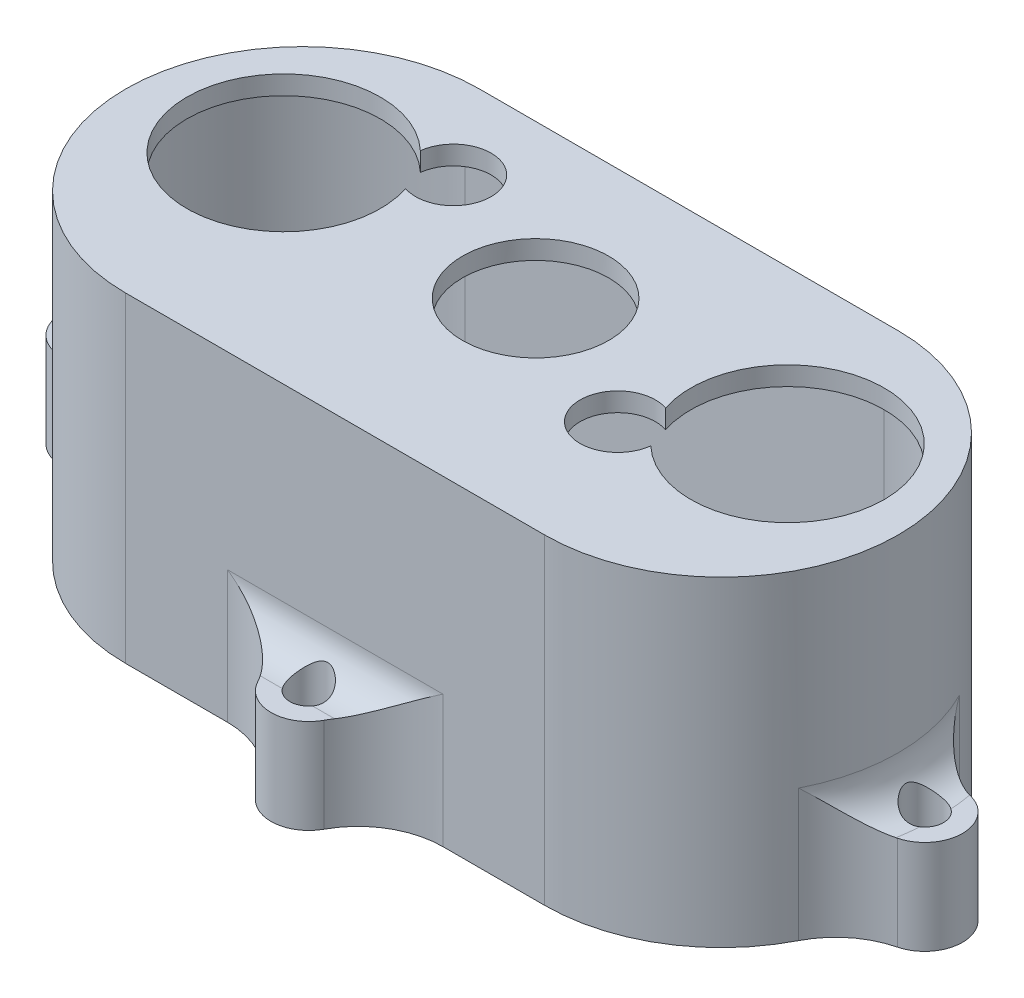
ISO-10303-21;
HEADER;
FILE_DESCRIPTION(('STEP AP214'),'2;1');
FILE_NAME('part.step','',(''),(''),'','','');
FILE_SCHEMA(('AUTOMOTIVE_DESIGN { 1 0 10303 214 1 1 1 1 }'));
ENDSEC;
DATA;
#1=APPLICATION_CONTEXT('core data for automotive mechanical design processes');
#2=APPLICATION_PROTOCOL_DEFINITION('international standard','automotive_design',2000,#1);
#3=PRODUCT_CONTEXT('',#1,'mechanical');
#4=PRODUCT('Part','Part','',(#3));
#5=PRODUCT_RELATED_PRODUCT_CATEGORY('part','',(#4));
#6=PRODUCT_DEFINITION_FORMATION('','',#4);
#7=PRODUCT_DEFINITION_CONTEXT('part definition',#1,'design');
#8=PRODUCT_DEFINITION('design','',#6,#7);
#9=PRODUCT_DEFINITION_SHAPE('','',#8);
#10=(LENGTH_UNIT() NAMED_UNIT(*) SI_UNIT(.MILLI.,.METRE.));
#11=(NAMED_UNIT(*) PLANE_ANGLE_UNIT() SI_UNIT($,.RADIAN.));
#12=(NAMED_UNIT(*) SI_UNIT($,.STERADIAN.) SOLID_ANGLE_UNIT());
#13=UNCERTAINTY_MEASURE_WITH_UNIT(LENGTH_MEASURE(1.E-05),#10,'distance_accuracy_value','');
#14=(GEOMETRIC_REPRESENTATION_CONTEXT(3) GLOBAL_UNCERTAINTY_ASSIGNED_CONTEXT((#13)) GLOBAL_UNIT_ASSIGNED_CONTEXT((#10,
#11,#12)) REPRESENTATION_CONTEXT('',''));
#15=CARTESIAN_POINT('',(0.,0.,0.));
#16=DIRECTION('',(0.,0.,1.));
#17=DIRECTION('',(1.,0.,0.));
#18=AXIS2_PLACEMENT_3D('',#15,#16,#17);
#19=CARTESIAN_POINT('',(-22.2,34.,0.));
#20=DIRECTION('',(0.,-1.,0.));
#21=DIRECTION('',(0.,0.,-1.));
#22=AXIS2_PLACEMENT_3D('',#19,#20,#21);
#23=CYLINDRICAL_SURFACE('',#22,18.7384881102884);
#24=DIRECTION('',(0.,-1.,0.));
#25=VECTOR('',#24,1.);
#26=CARTESIAN_POINT('',(-38.8910221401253,34.,-8.51708380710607));
#27=LINE('',#26,#25);
#28=CARTESIAN_POINT('',(-38.8910221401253,0.,-8.51708380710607));
#29=VERTEX_POINT('',#28);
#30=CARTESIAN_POINT('',(-38.8910221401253,14.,-8.51708380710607));
#31=VERTEX_POINT('',#30);
#32=EDGE_CURVE('E425',#29,#31,#27,.F.);
#33=ORIENTED_EDGE('',*,*,#32,.T.);
#34=CARTESIAN_POINT('',(-22.2,14.,0.));
#35=DIRECTION('',(0.,-1.,0.));
#36=DIRECTION('',(0.,0.,-1.));
#37=AXIS2_PLACEMENT_3D('',#34,#35,#36);
#38=CIRCLE('',#37,18.7384881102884);
#39=CARTESIAN_POINT('',(-38.8910221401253,14.,8.51708380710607));
#40=VERTEX_POINT('',#39);
#41=EDGE_CURVE('E496',#31,#40,#38,.F.);
#42=ORIENTED_EDGE('',*,*,#41,.T.);
#43=DIRECTION('',(0.,-1.,0.));
#44=VECTOR('',#43,1.);
#45=CARTESIAN_POINT('',(-38.8910221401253,34.,8.51708380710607));
#46=LINE('',#45,#44);
#47=CARTESIAN_POINT('',(-38.8910221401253,0.,8.51708380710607));
#48=VERTEX_POINT('',#47);
#49=EDGE_CURVE('E422',#40,#48,#46,.T.);
#50=ORIENTED_EDGE('',*,*,#49,.T.);
#51=CARTESIAN_POINT('',(-22.2,0.,0.));
#52=DIRECTION('',(0.,1.,0.));
#53=DIRECTION('',(0.,0.,1.));
#54=AXIS2_PLACEMENT_3D('',#51,#52,#53);
#55=CIRCLE('',#54,18.7384881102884);
#56=CARTESIAN_POINT('',(-22.2,0.,18.7384881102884));
#57=VERTEX_POINT('',#56);
#58=EDGE_CURVE('E322',#48,#57,#55,.T.);
#59=ORIENTED_EDGE('',*,*,#58,.T.);
#60=DIRECTION('',(0.,-1.,0.));
#61=VECTOR('',#60,1.);
#62=CARTESIAN_POINT('',(-22.2,34.,18.7384881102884));
#63=LINE('',#62,#61);
#64=CARTESIAN_POINT('',(-22.2,34.,18.7384881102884));
#65=VERTEX_POINT('',#64);
#66=EDGE_CURVE('E361',#65,#57,#63,.T.);
#67=ORIENTED_EDGE('',*,*,#66,.F.);
#68=CARTESIAN_POINT('',(-22.2,34.,0.));
#69=DIRECTION('',(0.,1.,0.));
#70=DIRECTION('',(0.,0.,1.));
#71=AXIS2_PLACEMENT_3D('',#68,#69,#70);
#72=CIRCLE('',#71,18.7384881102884);
#73=CARTESIAN_POINT('',(-22.2,34.,-18.7384881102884));
#74=VERTEX_POINT('',#73);
#75=EDGE_CURVE('E328',#74,#65,#72,.T.);
#76=ORIENTED_EDGE('',*,*,#75,.F.);
#77=DIRECTION('',(0.,-1.,0.));
#78=VECTOR('',#77,1.);
#79=CARTESIAN_POINT('',(-22.2,34.,-18.7384881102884));
#80=LINE('',#79,#78);
#81=CARTESIAN_POINT('',(-22.2,0.,-18.7384881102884));
#82=VERTEX_POINT('',#81);
#83=EDGE_CURVE('E338',#74,#82,#80,.T.);
#84=ORIENTED_EDGE('',*,*,#83,.T.);
#85=EDGE_CURVE('E339',#82,#29,#55,.T.);
#86=ORIENTED_EDGE('',*,*,#85,.T.);
#87=EDGE_LOOP('',(#33,#42,#50,#59,#67,#76,#84,#86));
#88=FACE_BOUND('',#87,.T.);
#89=ADVANCED_FACE('F33',(#88),#23,.T.);
#90=CARTESIAN_POINT('',(-22.2,34.,18.7384881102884));
#91=DIRECTION('',(0.,0.,-1.));
#92=DIRECTION('',(-1.,0.,0.));
#93=AXIS2_PLACEMENT_3D('',#90,#91,#92);
#94=PLANE('',#93);
#95=DIRECTION('',(0.,-1.,0.));
#96=VECTOR('',#95,1.);
#97=CARTESIAN_POINT('',(-11.4262854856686,34.,18.7384881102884));
#98=LINE('',#97,#96);
#99=CARTESIAN_POINT('',(-11.4262854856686,0.,18.7384881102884));
#100=VERTEX_POINT('',#99);
#101=CARTESIAN_POINT('',(-11.4262854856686,14.,18.7384881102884));
#102=VERTEX_POINT('',#101);
#103=EDGE_CURVE('E413',#100,#102,#98,.F.);
#104=ORIENTED_EDGE('',*,*,#103,.T.);
#105=DIRECTION('',(-1.,0.,0.));
#106=VECTOR('',#105,1.);
#107=CARTESIAN_POINT('',(11.4262854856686,14.,18.7384881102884));
#108=LINE('',#107,#106);
#109=CARTESIAN_POINT('',(11.4262854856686,14.,18.7384881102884));
#110=VERTEX_POINT('',#109);
#111=EDGE_CURVE('E472',#102,#110,#108,.F.);
#112=ORIENTED_EDGE('',*,*,#111,.T.);
#113=DIRECTION('',(0.,-1.,0.));
#114=VECTOR('',#113,1.);
#115=CARTESIAN_POINT('',(11.4262854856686,34.,18.7384881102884));
#116=LINE('',#115,#114);
#117=CARTESIAN_POINT('',(11.4262854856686,0.,18.7384881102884));
#118=VERTEX_POINT('',#117);
#119=EDGE_CURVE('E415',#110,#118,#116,.T.);
#120=ORIENTED_EDGE('',*,*,#119,.T.);
#121=DIRECTION('',(1.,0.,0.));
#122=VECTOR('',#121,1.);
#123=CARTESIAN_POINT('',(-22.2,0.,18.7384881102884));
#124=LINE('',#123,#122);
#125=CARTESIAN_POINT('',(22.2,0.,18.7384881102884));
#126=VERTEX_POINT('',#125);
#127=EDGE_CURVE('E342',#118,#126,#124,.T.);
#128=ORIENTED_EDGE('',*,*,#127,.T.);
#129=DIRECTION('',(0.,-1.,0.));
#130=VECTOR('',#129,1.);
#131=CARTESIAN_POINT('',(22.2,34.,18.7384881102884));
#132=LINE('',#131,#130);
#133=CARTESIAN_POINT('',(22.2,34.,18.7384881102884));
#134=VERTEX_POINT('',#133);
#135=EDGE_CURVE('E358',#134,#126,#132,.T.);
#136=ORIENTED_EDGE('',*,*,#135,.F.);
#137=DIRECTION('',(1.,0.,0.));
#138=VECTOR('',#137,1.);
#139=CARTESIAN_POINT('',(-22.2,34.,18.7384881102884));
#140=LINE('',#139,#138);
#141=EDGE_CURVE('E331',#65,#134,#140,.T.);
#142=ORIENTED_EDGE('',*,*,#141,.F.);
#143=ORIENTED_EDGE('',*,*,#66,.T.);
#144=EDGE_CURVE('E343',#57,#100,#124,.T.);
#145=ORIENTED_EDGE('',*,*,#144,.T.);
#146=EDGE_LOOP('',(#104,#112,#120,#128,#136,#142,#143,#145));
#147=FACE_BOUND('',#146,.T.);
#148=ADVANCED_FACE('F711',(#147),#94,.F.);
#149=CARTESIAN_POINT('',(22.2,34.,0.));
#150=DIRECTION('',(0.,-1.,0.));
#151=DIRECTION('',(0.,0.,-1.));
#152=AXIS2_PLACEMENT_3D('',#149,#150,#151);
#153=CYLINDRICAL_SURFACE('',#152,18.7384881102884);
#154=DIRECTION('',(0.,-1.,0.));
#155=VECTOR('',#154,1.);
#156=CARTESIAN_POINT('',(38.8910221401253,34.,8.51708380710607));
#157=LINE('',#156,#155);
#158=CARTESIAN_POINT('',(38.8910221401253,0.,8.51708380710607));
#159=VERTEX_POINT('',#158);
#160=CARTESIAN_POINT('',(38.8910221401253,14.,8.51708380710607));
#161=VERTEX_POINT('',#160);
#162=EDGE_CURVE('E404',#159,#161,#157,.F.);
#163=ORIENTED_EDGE('',*,*,#162,.T.);
#164=CARTESIAN_POINT('',(22.2,14.,0.));
#165=DIRECTION('',(0.,-1.,0.));
#166=DIRECTION('',(0.,0.,-1.));
#167=AXIS2_PLACEMENT_3D('',#164,#165,#166);
#168=CIRCLE('',#167,18.7384881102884);
#169=CARTESIAN_POINT('',(38.8910221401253,14.,-8.51708380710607));
#170=VERTEX_POINT('',#169);
#171=EDGE_CURVE('E480',#161,#170,#168,.F.);
#172=ORIENTED_EDGE('',*,*,#171,.T.);
#173=DIRECTION('',(0.,-1.,0.));
#174=VECTOR('',#173,1.);
#175=CARTESIAN_POINT('',(38.8910221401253,34.,-8.51708380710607));
#176=LINE('',#175,#174);
#177=CARTESIAN_POINT('',(38.8910221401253,0.,-8.51708380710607));
#178=VERTEX_POINT('',#177);
#179=EDGE_CURVE('E406',#170,#178,#176,.T.);
#180=ORIENTED_EDGE('',*,*,#179,.T.);
#181=CARTESIAN_POINT('',(22.2,0.,0.));
#182=DIRECTION('',(0.,1.,0.));
#183=DIRECTION('',(0.,0.,1.));
#184=AXIS2_PLACEMENT_3D('',#181,#182,#183);
#185=CIRCLE('',#184,18.7384881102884);
#186=CARTESIAN_POINT('',(22.2,0.,-18.7384881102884));
#187=VERTEX_POINT('',#186);
#188=EDGE_CURVE('E346',#178,#187,#185,.T.);
#189=ORIENTED_EDGE('',*,*,#188,.T.);
#190=DIRECTION('',(0.,-1.,0.));
#191=VECTOR('',#190,1.);
#192=CARTESIAN_POINT('',(22.2,34.,-18.7384881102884));
#193=LINE('',#192,#191);
#194=CARTESIAN_POINT('',(22.2,34.,-18.7384881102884));
#195=VERTEX_POINT('',#194);
#196=EDGE_CURVE('E355',#195,#187,#193,.T.);
#197=ORIENTED_EDGE('',*,*,#196,.F.);
#198=CARTESIAN_POINT('',(22.2,34.,0.));
#199=DIRECTION('',(0.,1.,0.));
#200=DIRECTION('',(0.,0.,1.));
#201=AXIS2_PLACEMENT_3D('',#198,#199,#200);
#202=CIRCLE('',#201,18.7384881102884);
#203=EDGE_CURVE('E334',#134,#195,#202,.T.);
#204=ORIENTED_EDGE('',*,*,#203,.F.);
#205=ORIENTED_EDGE('',*,*,#135,.T.);
#206=EDGE_CURVE('E347',#126,#159,#185,.T.);
#207=ORIENTED_EDGE('',*,*,#206,.T.);
#208=EDGE_LOOP('',(#163,#172,#180,#189,#197,#204,#205,#207));
#209=FACE_BOUND('',#208,.T.);
#210=ADVANCED_FACE('F716',(#209),#153,.T.);
#211=CARTESIAN_POINT('',(-22.2,34.,-18.7384881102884));
#212=DIRECTION('',(0.,0.,1.));
#213=DIRECTION('',(1.,0.,0.));
#214=AXIS2_PLACEMENT_3D('',#211,#212,#213);
#215=PLANE('',#214);
#216=DIRECTION('',(0.,-1.,0.));
#217=VECTOR('',#216,1.);
#218=CARTESIAN_POINT('',(11.4262854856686,34.,-18.7384881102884));
#219=LINE('',#218,#217);
#220=CARTESIAN_POINT('',(11.4262854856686,0.,-18.7384881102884));
#221=VERTEX_POINT('',#220);
#222=CARTESIAN_POINT('',(11.4262854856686,14.,-18.7384881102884));
#223=VERTEX_POINT('',#222);
#224=EDGE_CURVE('E385',#221,#223,#219,.F.);
#225=ORIENTED_EDGE('',*,*,#224,.T.);
#226=DIRECTION('',(1.,0.,0.));
#227=VECTOR('',#226,1.);
#228=CARTESIAN_POINT('',(-11.4262854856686,14.,-18.7384881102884));
#229=LINE('',#228,#227);
#230=CARTESIAN_POINT('',(-11.4262854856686,14.,-18.7384881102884));
#231=VERTEX_POINT('',#230);
#232=EDGE_CURVE('E488',#223,#231,#229,.F.);
#233=ORIENTED_EDGE('',*,*,#232,.T.);
#234=DIRECTION('',(0.,-1.,0.));
#235=VECTOR('',#234,1.);
#236=CARTESIAN_POINT('',(-11.4262854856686,34.,-18.7384881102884));
#237=LINE('',#236,#235);
#238=CARTESIAN_POINT('',(-11.4262854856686,0.,-18.7384881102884));
#239=VERTEX_POINT('',#238);
#240=EDGE_CURVE('E397',#231,#239,#237,.T.);
#241=ORIENTED_EDGE('',*,*,#240,.T.);
#242=DIRECTION('',(-1.,0.,0.));
#243=VECTOR('',#242,1.);
#244=CARTESIAN_POINT('',(-22.2,0.,-18.7384881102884));
#245=LINE('',#244,#243);
#246=EDGE_CURVE('E350',#239,#82,#245,.T.);
#247=ORIENTED_EDGE('',*,*,#246,.T.);
#248=ORIENTED_EDGE('',*,*,#83,.F.);
#249=DIRECTION('',(-1.,0.,0.));
#250=VECTOR('',#249,1.);
#251=CARTESIAN_POINT('',(-22.2,34.,-18.7384881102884));
#252=LINE('',#251,#250);
#253=EDGE_CURVE('E336',#195,#74,#252,.T.);
#254=ORIENTED_EDGE('',*,*,#253,.F.);
#255=ORIENTED_EDGE('',*,*,#196,.T.);
#256=EDGE_CURVE('E332',#187,#221,#245,.T.);
#257=ORIENTED_EDGE('',*,*,#256,.T.);
#258=EDGE_LOOP('',(#225,#233,#241,#247,#248,#254,#255,#257));
#259=FACE_BOUND('',#258,.T.);
#260=ADVANCED_FACE('F654',(#259),#215,.F.);
#261=CARTESIAN_POINT('',(-22.2,34.,0.));
#262=DIRECTION('',(0.,1.,0.));
#263=DIRECTION('',(0.,0.,1.));
#264=AXIS2_PLACEMENT_3D('',#261,#262,#263);
#265=PLANE('',#264);
#266=CARTESIAN_POINT('',(-15.6796894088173,34.,-9.46862552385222));
#267=DIRECTION('',(0.,1.,0.));
#268=DIRECTION('',(0.,0.,1.));
#269=AXIS2_PLACEMENT_3D('',#266,#267,#268);
#270=CIRCLE('',#269,4.);
#271=CARTESIAN_POINT('',(-16.9548982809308,34.,-5.67734047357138));
#272=VERTEX_POINT('',#271);
#273=CARTESIAN_POINT('',(-19.6515880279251,34.,-9.94193447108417));
#274=VERTEX_POINT('',#273);
#275=EDGE_CURVE('E277',#272,#274,#270,.T.);
#276=ORIENTED_EDGE('',*,*,#275,.F.);
#277=CARTESIAN_POINT('',(-26.7,34.,-2.5));
#278=DIRECTION('',(0.,1.,0.));
#279=DIRECTION('',(0.,0.,1.));
#280=AXIS2_PLACEMENT_3D('',#277,#278,#279);
#281=CIRCLE('',#280,10.25);
#282=EDGE_CURVE('E286',#274,#272,#281,.T.);
#283=ORIENTED_EDGE('',*,*,#282,.F.);
#284=EDGE_LOOP('',(#276,#283));
#285=FACE_BOUND('',#284,.T.);
#286=CARTESIAN_POINT('',(15.6800336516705,34.,4.46862552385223));
#287=DIRECTION('',(0.,1.,0.));
#288=DIRECTION('',(0.,0.,1.));
#289=AXIS2_PLACEMENT_3D('',#286,#287,#288);
#290=CIRCLE('',#289,4.);
#291=CARTESIAN_POINT('',(16.9548558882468,34.,0.677210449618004));
#292=VERTEX_POINT('',#291);
#293=CARTESIAN_POINT('',(19.6518973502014,34.,4.94222742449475));
#294=VERTEX_POINT('',#293);
#295=EDGE_CURVE('E583',#292,#294,#290,.T.);
#296=ORIENTED_EDGE('',*,*,#295,.F.);
#297=CARTESIAN_POINT('',(26.7,34.,-2.5));
#298=DIRECTION('',(0.,1.,0.));
#299=DIRECTION('',(0.,0.,1.));
#300=AXIS2_PLACEMENT_3D('',#297,#298,#299);
#301=CIRCLE('',#300,10.25);
#302=EDGE_CURVE('E292',#294,#292,#301,.T.);
#303=ORIENTED_EDGE('',*,*,#302,.F.);
#304=EDGE_LOOP('',(#296,#303));
#305=FACE_BOUND('',#304,.T.);
#306=CARTESIAN_POINT('',(0.,34.,-2.5));
#307=DIRECTION('',(0.,1.,0.));
#308=DIRECTION('',(0.,0.,1.));
#309=AXIS2_PLACEMENT_3D('',#306,#307,#308);
#310=CIRCLE('',#309,7.75);
#311=CARTESIAN_POINT('',(0.,34.,5.25));
#312=VERTEX_POINT('',#311);
#313=EDGE_CURVE('E303',#312,#312,#310,.T.);
#314=ORIENTED_EDGE('',*,*,#313,.F.);
#315=EDGE_LOOP('',(#314));
#316=FACE_BOUND('',#315,.T.);
#317=ORIENTED_EDGE('',*,*,#75,.T.);
#318=ORIENTED_EDGE('',*,*,#141,.T.);
#319=ORIENTED_EDGE('',*,*,#203,.T.);
#320=ORIENTED_EDGE('',*,*,#253,.T.);
#321=EDGE_LOOP('',(#317,#318,#319,#320));
#322=FACE_BOUND('',#321,.T.);
#323=ADVANCED_FACE('F289',(#285,#305,#316,#322),#265,.T.);
#324=CARTESIAN_POINT('',(-22.2,0.,0.));
#325=DIRECTION('',(0.,1.,0.));
#326=DIRECTION('',(0.,0.,1.));
#327=AXIS2_PLACEMENT_3D('',#324,#325,#326);
#328=PLANE('',#327);
#329=DIRECTION('',(-1.,0.,0.));
#330=VECTOR('',#329,1.);
#331=CARTESIAN_POINT('',(22.2,0.,17.2384881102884));
#332=LINE('',#331,#330);
#333=CARTESIAN_POINT('',(22.2,0.,17.2384881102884));
#334=VERTEX_POINT('',#333);
#335=CARTESIAN_POINT('',(-22.2,0.,17.2384881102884));
#336=VERTEX_POINT('',#335);
#337=EDGE_CURVE('E310',#334,#336,#332,.T.);
#338=ORIENTED_EDGE('',*,*,#337,.F.);
#339=CARTESIAN_POINT('',(22.2,0.,0.));
#340=DIRECTION('',(0.,-1.,0.));
#341=DIRECTION('',(0.,0.,-1.));
#342=AXIS2_PLACEMENT_3D('',#339,#340,#341);
#343=CIRCLE('',#342,17.2384881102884);
#344=CARTESIAN_POINT('',(22.2,0.,-17.2384881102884));
#345=VERTEX_POINT('',#344);
#346=EDGE_CURVE('E307',#345,#334,#343,.T.);
#347=ORIENTED_EDGE('',*,*,#346,.F.);
#348=DIRECTION('',(1.,0.,0.));
#349=VECTOR('',#348,1.);
#350=CARTESIAN_POINT('',(-22.2,0.,-17.2384881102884));
#351=LINE('',#350,#349);
#352=CARTESIAN_POINT('',(-22.2,0.,-17.2384881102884));
#353=VERTEX_POINT('',#352);
#354=EDGE_CURVE('E316',#353,#345,#351,.T.);
#355=ORIENTED_EDGE('',*,*,#354,.F.);
#356=CARTESIAN_POINT('',(-22.2,0.,0.));
#357=DIRECTION('',(0.,-1.,0.));
#358=DIRECTION('',(0.,0.,-1.));
#359=AXIS2_PLACEMENT_3D('',#356,#357,#358);
#360=CIRCLE('',#359,17.2384881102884);
#361=EDGE_CURVE('E313',#336,#353,#360,.T.);
#362=ORIENTED_EDGE('',*,*,#361,.F.);
#363=EDGE_LOOP('',(#338,#347,#355,#362));
#364=FACE_BOUND('',#363,.T.);
#365=ORIENTED_EDGE('',*,*,#188,.F.);
#366=CARTESIAN_POINT('',(46.9076347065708,0.,-12.6077955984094));
#367=DIRECTION('',(0.,1.,0.));
#368=DIRECTION('',(0.,0.,1.));
#369=AXIS2_PLACEMENT_3D('',#366,#367,#368);
#370=CIRCLE('',#369,9.);
#371=CARTESIAN_POINT('',(44.7136101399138,0.,-3.87932172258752));
#372=VERTEX_POINT('',#371);
#373=EDGE_CURVE('E440',#178,#372,#370,.T.);
#374=ORIENTED_EDGE('',*,*,#373,.T.);
#375=CARTESIAN_POINT('',(43.7384881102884,0.,0.));
#376=DIRECTION('',(0.,-1.,0.));
#377=DIRECTION('',(0.,0.,-1.));
#378=AXIS2_PLACEMENT_3D('',#375,#376,#377);
#379=CIRCLE('',#378,4.00000000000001);
#380=CARTESIAN_POINT('',(44.7136101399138,0.,3.87932172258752));
#381=VERTEX_POINT('',#380);
#382=EDGE_CURVE('E592',#372,#381,#379,.T.);
#383=ORIENTED_EDGE('',*,*,#382,.T.);
#384=CARTESIAN_POINT('',(46.9076347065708,0.,12.6077955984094));
#385=DIRECTION('',(0.,1.,0.));
#386=DIRECTION('',(0.,0.,1.));
#387=AXIS2_PLACEMENT_3D('',#384,#385,#386);
#388=CIRCLE('',#387,9.);
#389=EDGE_CURVE('E447',#381,#159,#388,.T.);
#390=ORIENTED_EDGE('',*,*,#389,.T.);
#391=ORIENTED_EDGE('',*,*,#206,.F.);
#392=ORIENTED_EDGE('',*,*,#127,.F.);
#393=CARTESIAN_POINT('',(11.4262854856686,0.,27.7384881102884));
#394=DIRECTION('',(0.,1.,0.));
#395=DIRECTION('',(0.,0.,1.));
#396=AXIS2_PLACEMENT_3D('',#393,#394,#395);
#397=CIRCLE('',#396,9.);
#398=CARTESIAN_POINT('',(3.51578014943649,0.,23.4461804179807));
#399=VERTEX_POINT('',#398);
#400=EDGE_CURVE('E449',#118,#399,#397,.T.);
#401=ORIENTED_EDGE('',*,*,#400,.T.);
#402=CARTESIAN_POINT('',(0.,0.,21.5384881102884));
#403=DIRECTION('',(0.,-1.,0.));
#404=DIRECTION('',(0.,0.,-1.));
#405=AXIS2_PLACEMENT_3D('',#402,#403,#404);
#406=CIRCLE('',#405,4.00000000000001);
#407=CARTESIAN_POINT('',(-3.51578014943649,0.,23.4461804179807));
#408=VERTEX_POINT('',#407);
#409=EDGE_CURVE('E604',#399,#408,#406,.T.);
#410=ORIENTED_EDGE('',*,*,#409,.T.);
#411=CARTESIAN_POINT('',(-11.4262854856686,0.,27.7384881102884));
#412=DIRECTION('',(0.,1.,0.));
#413=DIRECTION('',(0.,0.,1.));
#414=AXIS2_PLACEMENT_3D('',#411,#412,#413);
#415=CIRCLE('',#414,9.);
#416=EDGE_CURVE('E456',#408,#100,#415,.T.);
#417=ORIENTED_EDGE('',*,*,#416,.T.);
#418=ORIENTED_EDGE('',*,*,#144,.F.);
#419=ORIENTED_EDGE('',*,*,#58,.F.);
#420=CARTESIAN_POINT('',(-46.9076347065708,0.,12.6077955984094));
#421=DIRECTION('',(0.,1.,0.));
#422=DIRECTION('',(0.,0.,1.));
#423=AXIS2_PLACEMENT_3D('',#420,#421,#422);
#424=CIRCLE('',#423,9.);
#425=CARTESIAN_POINT('',(-44.7136101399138,0.,3.87932172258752));
#426=VERTEX_POINT('',#425);
#427=EDGE_CURVE('E462',#48,#426,#424,.T.);
#428=ORIENTED_EDGE('',*,*,#427,.T.);
#429=CARTESIAN_POINT('',(-43.7384881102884,0.,0.));
#430=DIRECTION('',(0.,-1.,0.));
#431=DIRECTION('',(0.,0.,-1.));
#432=AXIS2_PLACEMENT_3D('',#429,#430,#431);
#433=CIRCLE('',#432,4.00000000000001);
#434=CARTESIAN_POINT('',(-44.7136101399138,0.,-3.87932172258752));
#435=VERTEX_POINT('',#434);
#436=EDGE_CURVE('E300',#426,#435,#433,.T.);
#437=ORIENTED_EDGE('',*,*,#436,.T.);
#438=CARTESIAN_POINT('',(-46.9076347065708,0.,-12.6077955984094));
#439=DIRECTION('',(0.,1.,0.));
#440=DIRECTION('',(0.,0.,1.));
#441=AXIS2_PLACEMENT_3D('',#438,#439,#440);
#442=CIRCLE('',#441,9.);
#443=EDGE_CURVE('E460',#435,#29,#442,.T.);
#444=ORIENTED_EDGE('',*,*,#443,.T.);
#445=ORIENTED_EDGE('',*,*,#85,.F.);
#446=ORIENTED_EDGE('',*,*,#246,.F.);
#447=CARTESIAN_POINT('',(-11.4262854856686,0.,-27.7384881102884));
#448=DIRECTION('',(0.,1.,0.));
#449=DIRECTION('',(0.,0.,1.));
#450=AXIS2_PLACEMENT_3D('',#447,#448,#449);
#451=CIRCLE('',#450,9.);
#452=CARTESIAN_POINT('',(-3.51578014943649,0.,-23.4461804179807));
#453=VERTEX_POINT('',#452);
#454=EDGE_CURVE('E431',#239,#453,#451,.T.);
#455=ORIENTED_EDGE('',*,*,#454,.T.);
#456=CARTESIAN_POINT('',(0.,0.,-21.5384881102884));
#457=DIRECTION('',(0.,-1.,0.));
#458=DIRECTION('',(0.,0.,-1.));
#459=AXIS2_PLACEMENT_3D('',#456,#457,#458);
#460=CIRCLE('',#459,4.00000000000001);
#461=CARTESIAN_POINT('',(3.51578014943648,0.,-23.4461804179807));
#462=VERTEX_POINT('',#461);
#463=EDGE_CURVE('E616',#453,#462,#460,.T.);
#464=ORIENTED_EDGE('',*,*,#463,.T.);
#465=CARTESIAN_POINT('',(11.4262854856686,0.,-27.7384881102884));
#466=DIRECTION('',(0.,1.,0.));
#467=DIRECTION('',(0.,0.,1.));
#468=AXIS2_PLACEMENT_3D('',#465,#466,#467);
#469=CIRCLE('',#468,9.);
#470=EDGE_CURVE('E438',#462,#221,#469,.T.);
#471=ORIENTED_EDGE('',*,*,#470,.T.);
#472=ORIENTED_EDGE('',*,*,#256,.F.);
#473=EDGE_LOOP('',(#365,#374,#383,#390,#391,#392,#401,#410,#417,#418,#419,#428,#437,#444,#445,
#446,#455,#464,#471,#472));
#474=FACE_BOUND('',#473,.T.);
#475=CARTESIAN_POINT('',(-43.7384881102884,0.,0.));
#476=DIRECTION('',(0.,-1.,0.));
#477=DIRECTION('',(0.,0.,-1.));
#478=AXIS2_PLACEMENT_3D('',#475,#476,#477);
#479=CIRCLE('',#478,2.);
#480=CARTESIAN_POINT('',(-43.7384881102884,0.,-2.));
#481=VERTEX_POINT('',#480);
#482=EDGE_CURVE('E622',#481,#481,#479,.T.);
#483=ORIENTED_EDGE('',*,*,#482,.F.);
#484=EDGE_LOOP('',(#483));
#485=FACE_BOUND('',#484,.T.);
#486=CARTESIAN_POINT('',(0.,0.,-21.5384881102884));
#487=DIRECTION('',(0.,-1.,0.));
#488=DIRECTION('',(0.,0.,-1.));
#489=AXIS2_PLACEMENT_3D('',#486,#487,#488);
#490=CIRCLE('',#489,2.);
#491=CARTESIAN_POINT('',(0.,0.,-23.5384881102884));
#492=VERTEX_POINT('',#491);
#493=EDGE_CURVE('E610',#492,#492,#490,.T.);
#494=ORIENTED_EDGE('',*,*,#493,.F.);
#495=EDGE_LOOP('',(#494));
#496=FACE_BOUND('',#495,.T.);
#497=CARTESIAN_POINT('',(0.,0.,21.5384881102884));
#498=DIRECTION('',(0.,-1.,0.));
#499=DIRECTION('',(0.,0.,-1.));
#500=AXIS2_PLACEMENT_3D('',#497,#498,#499);
#501=CIRCLE('',#500,2.);
#502=CARTESIAN_POINT('',(0.,0.,19.5384881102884));
#503=VERTEX_POINT('',#502);
#504=EDGE_CURVE('E598',#503,#503,#501,.T.);
#505=ORIENTED_EDGE('',*,*,#504,.F.);
#506=EDGE_LOOP('',(#505));
#507=FACE_BOUND('',#506,.T.);
#508=CARTESIAN_POINT('',(43.7384881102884,0.,0.));
#509=DIRECTION('',(0.,-1.,0.));
#510=DIRECTION('',(0.,0.,-1.));
#511=AXIS2_PLACEMENT_3D('',#508,#509,#510);
#512=CIRCLE('',#511,2.);
#513=CARTESIAN_POINT('',(43.7384881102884,0.,-2.));
#514=VERTEX_POINT('',#513);
#515=EDGE_CURVE('E588',#514,#514,#512,.T.);
#516=ORIENTED_EDGE('',*,*,#515,.F.);
#517=EDGE_LOOP('',(#516));
#518=FACE_BOUND('',#517,.T.);
#519=ADVANCED_FACE('F638',(#364,#474,#485,#496,#507,#518),#328,.F.);
#520=CARTESIAN_POINT('',(22.2,32.,0.));
#521=DIRECTION('',(0.,-1.,0.));
#522=DIRECTION('',(0.,0.,-1.));
#523=AXIS2_PLACEMENT_3D('',#520,#521,#522);
#524=CYLINDRICAL_SURFACE('',#523,17.2384881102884);
#525=DIRECTION('',(0.,-1.,0.));
#526=VECTOR('',#525,1.);
#527=CARTESIAN_POINT('',(22.2,32.,17.2384881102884));
#528=LINE('',#527,#526);
#529=CARTESIAN_POINT('',(22.2,31.,17.2384881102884));
#530=VERTEX_POINT('',#529);
#531=EDGE_CURVE('E319',#530,#334,#528,.T.);
#532=ORIENTED_EDGE('',*,*,#531,.F.);
#533=CARTESIAN_POINT('',(22.2,31.,0.));
#534=DIRECTION('',(0.,-1.,0.));
#535=DIRECTION('',(0.,0.,-1.));
#536=AXIS2_PLACEMENT_3D('',#533,#534,#535);
#537=CIRCLE('',#536,17.2384881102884);
#538=CARTESIAN_POINT('',(22.2,31.,-17.2384881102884));
#539=VERTEX_POINT('',#538);
#540=EDGE_CURVE('E381',#530,#539,#537,.F.);
#541=ORIENTED_EDGE('',*,*,#540,.T.);
#542=DIRECTION('',(0.,-1.,0.));
#543=VECTOR('',#542,1.);
#544=CARTESIAN_POINT('',(22.2,32.,-17.2384881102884));
#545=LINE('',#544,#543);
#546=EDGE_CURVE('E320',#539,#345,#545,.T.);
#547=ORIENTED_EDGE('',*,*,#546,.T.);
#548=ORIENTED_EDGE('',*,*,#346,.T.);
#549=EDGE_LOOP('',(#532,#541,#547,#548));
#550=FACE_BOUND('',#549,.T.);
#551=ADVANCED_FACE('F836',(#550),#524,.F.);
#552=CARTESIAN_POINT('',(-22.2,32.,-17.2384881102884));
#553=DIRECTION('',(0.,0.,-1.));
#554=DIRECTION('',(-1.,0.,0.));
#555=AXIS2_PLACEMENT_3D('',#552,#553,#554);
#556=PLANE('',#555);
#557=ORIENTED_EDGE('',*,*,#546,.F.);
#558=DIRECTION('',(1.,0.,0.));
#559=VECTOR('',#558,1.);
#560=CARTESIAN_POINT('',(-22.2,31.,-17.2384881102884));
#561=LINE('',#560,#559);
#562=CARTESIAN_POINT('',(-22.2,31.,-17.2384881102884));
#563=VERTEX_POINT('',#562);
#564=EDGE_CURVE('E383',#539,#563,#561,.F.);
#565=ORIENTED_EDGE('',*,*,#564,.T.);
#566=DIRECTION('',(0.,-1.,0.));
#567=VECTOR('',#566,1.);
#568=CARTESIAN_POINT('',(-22.2,32.,-17.2384881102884));
#569=LINE('',#568,#567);
#570=EDGE_CURVE('E323',#563,#353,#569,.T.);
#571=ORIENTED_EDGE('',*,*,#570,.T.);
#572=ORIENTED_EDGE('',*,*,#354,.T.);
#573=EDGE_LOOP('',(#557,#565,#571,#572));
#574=FACE_BOUND('',#573,.T.);
#575=ADVANCED_FACE('F877',(#574),#556,.F.);
#576=CARTESIAN_POINT('',(-22.2,32.,0.));
#577=DIRECTION('',(0.,-1.,0.));
#578=DIRECTION('',(0.,0.,-1.));
#579=AXIS2_PLACEMENT_3D('',#576,#577,#578);
#580=CYLINDRICAL_SURFACE('',#579,17.2384881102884);
#581=ORIENTED_EDGE('',*,*,#570,.F.);
#582=CARTESIAN_POINT('',(-22.2,31.,0.));
#583=DIRECTION('',(0.,-1.,0.));
#584=DIRECTION('',(0.,0.,-1.));
#585=AXIS2_PLACEMENT_3D('',#582,#583,#584);
#586=CIRCLE('',#585,17.2384881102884);
#587=CARTESIAN_POINT('',(-22.2,31.,17.2384881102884));
#588=VERTEX_POINT('',#587);
#589=EDGE_CURVE('E376',#563,#588,#586,.F.);
#590=ORIENTED_EDGE('',*,*,#589,.T.);
#591=DIRECTION('',(0.,-1.,0.));
#592=VECTOR('',#591,1.);
#593=CARTESIAN_POINT('',(-22.2,32.,17.2384881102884));
#594=LINE('',#593,#592);
#595=EDGE_CURVE('E325',#588,#336,#594,.T.);
#596=ORIENTED_EDGE('',*,*,#595,.T.);
#597=ORIENTED_EDGE('',*,*,#361,.T.);
#598=EDGE_LOOP('',(#581,#590,#596,#597));
#599=FACE_BOUND('',#598,.T.);
#600=ADVANCED_FACE('F880',(#599),#580,.F.);
#601=CARTESIAN_POINT('',(22.2,32.,17.2384881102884));
#602=DIRECTION('',(0.,0.,1.));
#603=DIRECTION('',(1.,0.,0.));
#604=AXIS2_PLACEMENT_3D('',#601,#602,#603);
#605=PLANE('',#604);
#606=ORIENTED_EDGE('',*,*,#595,.F.);
#607=DIRECTION('',(-1.,0.,0.));
#608=VECTOR('',#607,1.);
#609=CARTESIAN_POINT('',(22.2,31.,17.2384881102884));
#610=LINE('',#609,#608);
#611=EDGE_CURVE('E379',#588,#530,#610,.F.);
#612=ORIENTED_EDGE('',*,*,#611,.T.);
#613=ORIENTED_EDGE('',*,*,#531,.T.);
#614=ORIENTED_EDGE('',*,*,#337,.T.);
#615=EDGE_LOOP('',(#606,#612,#613,#614));
#616=FACE_BOUND('',#615,.T.);
#617=ADVANCED_FACE('F876',(#616),#605,.F.);
#618=CARTESIAN_POINT('',(22.2,32.,0.));
#619=DIRECTION('',(0.,-1.,0.));
#620=DIRECTION('',(0.,0.,-1.));
#621=AXIS2_PLACEMENT_3D('',#618,#619,#620);
#622=PLANE('',#621);
#623=CARTESIAN_POINT('',(-15.6796894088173,32.,-9.46862552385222));
#624=DIRECTION('',(0.,-1.,0.));
#625=DIRECTION('',(0.,0.,-1.));
#626=AXIS2_PLACEMENT_3D('',#623,#624,#625);
#627=CIRCLE('',#626,4.);
#628=CARTESIAN_POINT('',(-19.6515880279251,32.,-9.94193447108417));
#629=VERTEX_POINT('',#628);
#630=CARTESIAN_POINT('',(-16.9548982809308,32.,-5.67734047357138));
#631=VERTEX_POINT('',#630);
#632=EDGE_CURVE('E49',#629,#631,#627,.T.);
#633=ORIENTED_EDGE('',*,*,#632,.F.);
#634=CARTESIAN_POINT('',(-26.7,32.,-2.5));
#635=DIRECTION('',(0.,-1.,0.));
#636=DIRECTION('',(0.,0.,-1.));
#637=AXIS2_PLACEMENT_3D('',#634,#635,#636);
#638=CIRCLE('',#637,10.25);
#639=EDGE_CURVE('E288',#631,#629,#638,.T.);
#640=ORIENTED_EDGE('',*,*,#639,.F.);
#641=EDGE_LOOP('',(#633,#640));
#642=FACE_BOUND('',#641,.T.);
#643=CARTESIAN_POINT('',(15.6800336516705,32.,4.46862552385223));
#644=DIRECTION('',(0.,-1.,0.));
#645=DIRECTION('',(0.,0.,-1.));
#646=AXIS2_PLACEMENT_3D('',#643,#644,#645);
#647=CIRCLE('',#646,4.);
#648=CARTESIAN_POINT('',(19.6518973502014,32.,4.94222742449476));
#649=VERTEX_POINT('',#648);
#650=CARTESIAN_POINT('',(16.9548558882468,32.,0.677210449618));
#651=VERTEX_POINT('',#650);
#652=EDGE_CURVE('E57',#649,#651,#647,.T.);
#653=ORIENTED_EDGE('',*,*,#652,.F.);
#654=CARTESIAN_POINT('',(26.7,32.,-2.5));
#655=DIRECTION('',(0.,-1.,0.));
#656=DIRECTION('',(0.,0.,-1.));
#657=AXIS2_PLACEMENT_3D('',#654,#655,#656);
#658=CIRCLE('',#657,10.25);
#659=EDGE_CURVE('E291',#651,#649,#658,.T.);
#660=ORIENTED_EDGE('',*,*,#659,.F.);
#661=EDGE_LOOP('',(#653,#660));
#662=FACE_BOUND('',#661,.T.);
#663=DIRECTION('',(-1.,0.,0.));
#664=VECTOR('',#663,1.);
#665=CARTESIAN_POINT('',(22.2,32.,16.2384881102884));
#666=LINE('',#665,#664);
#667=CARTESIAN_POINT('',(22.2,32.,16.2384881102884));
#668=VERTEX_POINT('',#667);
#669=CARTESIAN_POINT('',(-22.2,32.,16.2384881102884));
#670=VERTEX_POINT('',#669);
#671=EDGE_CURVE('E371',#668,#670,#666,.T.);
#672=ORIENTED_EDGE('',*,*,#671,.T.);
#673=CARTESIAN_POINT('',(-22.2,32.,0.));
#674=DIRECTION('',(0.,-1.,0.));
#675=DIRECTION('',(0.,0.,-1.));
#676=AXIS2_PLACEMENT_3D('',#673,#674,#675);
#677=CIRCLE('',#676,16.2384881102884);
#678=CARTESIAN_POINT('',(-22.2,32.,-16.2384881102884));
#679=VERTEX_POINT('',#678);
#680=EDGE_CURVE('E373',#670,#679,#677,.T.);
#681=ORIENTED_EDGE('',*,*,#680,.T.);
#682=DIRECTION('',(1.,0.,0.));
#683=VECTOR('',#682,1.);
#684=CARTESIAN_POINT('',(22.2,32.,-16.2384881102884));
#685=LINE('',#684,#683);
#686=CARTESIAN_POINT('',(22.2,32.,-16.2384881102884));
#687=VERTEX_POINT('',#686);
#688=EDGE_CURVE('E364',#679,#687,#685,.T.);
#689=ORIENTED_EDGE('',*,*,#688,.T.);
#690=CARTESIAN_POINT('',(22.2,32.,0.));
#691=DIRECTION('',(0.,-1.,0.));
#692=DIRECTION('',(0.,0.,-1.));
#693=AXIS2_PLACEMENT_3D('',#690,#691,#692);
#694=CIRCLE('',#693,16.2384881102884);
#695=EDGE_CURVE('E369',#687,#668,#694,.T.);
#696=ORIENTED_EDGE('',*,*,#695,.T.);
#697=EDGE_LOOP('',(#672,#681,#689,#696));
#698=FACE_BOUND('',#697,.T.);
#699=CARTESIAN_POINT('',(0.,32.,-2.5));
#700=DIRECTION('',(0.,-1.,0.));
#701=DIRECTION('',(0.,0.,-1.));
#702=AXIS2_PLACEMENT_3D('',#699,#700,#701);
#703=CIRCLE('',#702,7.75);
#704=CARTESIAN_POINT('',(0.,32.,-10.25));
#705=VERTEX_POINT('',#704);
#706=EDGE_CURVE('E306',#705,#705,#703,.T.);
#707=ORIENTED_EDGE('',*,*,#706,.F.);
#708=EDGE_LOOP('',(#707));
#709=FACE_BOUND('',#708,.T.);
#710=ADVANCED_FACE('F581',(#642,#662,#698,#709),#622,.T.);
#711=CARTESIAN_POINT('',(0.,26.,-2.5));
#712=DIRECTION('',(0.,1.,0.));
#713=DIRECTION('',(0.,0.,1.));
#714=AXIS2_PLACEMENT_3D('',#711,#712,#713);
#715=CYLINDRICAL_SURFACE('',#714,7.75);
#716=ORIENTED_EDGE('',*,*,#706,.T.);
#717=EDGE_LOOP('',(#716));
#718=FACE_BOUND('',#717,.T.);
#719=ORIENTED_EDGE('',*,*,#313,.T.);
#720=EDGE_LOOP('',(#719));
#721=FACE_BOUND('',#720,.T.);
#722=ADVANCED_FACE('F869',(#718,#721),#715,.F.);
#723=CARTESIAN_POINT('',(26.7,26.,-2.5));
#724=DIRECTION('',(0.,1.,0.));
#725=DIRECTION('',(0.,0.,1.));
#726=AXIS2_PLACEMENT_3D('',#723,#724,#725);
#727=CYLINDRICAL_SURFACE('',#726,10.25);
#728=ORIENTED_EDGE('',*,*,#659,.T.);
#729=DIRECTION('',(0.,1.,0.));
#730=VECTOR('',#729,1.);
#731=CARTESIAN_POINT('',(19.6518973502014,29.,4.94222742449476));
#732=LINE('',#731,#730);
#733=EDGE_CURVE('E578',#649,#294,#732,.T.);
#734=ORIENTED_EDGE('',*,*,#733,.T.);
#735=ORIENTED_EDGE('',*,*,#302,.T.);
#736=DIRECTION('',(0.,1.,0.));
#737=VECTOR('',#736,1.);
#738=CARTESIAN_POINT('',(16.9548558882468,29.,0.677210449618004));
#739=LINE('',#738,#737);
#740=EDGE_CURVE('E576',#292,#651,#739,.F.);
#741=ORIENTED_EDGE('',*,*,#740,.T.);
#742=EDGE_LOOP('',(#728,#734,#735,#741));
#743=FACE_BOUND('',#742,.T.);
#744=ADVANCED_FACE('F866',(#743),#727,.F.);
#745=CARTESIAN_POINT('',(-26.7,26.,-2.5));
#746=DIRECTION('',(0.,1.,0.));
#747=DIRECTION('',(0.,0.,1.));
#748=AXIS2_PLACEMENT_3D('',#745,#746,#747);
#749=CYLINDRICAL_SURFACE('',#748,10.25);
#750=ORIENTED_EDGE('',*,*,#639,.T.);
#751=DIRECTION('',(0.,1.,0.));
#752=VECTOR('',#751,1.);
#753=CARTESIAN_POINT('',(-19.6515880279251,29.,-9.94193447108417));
#754=LINE('',#753,#752);
#755=EDGE_CURVE('E11',#629,#274,#754,.T.);
#756=ORIENTED_EDGE('',*,*,#755,.T.);
#757=ORIENTED_EDGE('',*,*,#282,.T.);
#758=DIRECTION('',(0.,1.,0.));
#759=VECTOR('',#758,1.);
#760=CARTESIAN_POINT('',(-16.9548982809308,29.,-5.67734047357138));
#761=LINE('',#760,#759);
#762=EDGE_CURVE('E42',#272,#631,#761,.F.);
#763=ORIENTED_EDGE('',*,*,#762,.T.);
#764=EDGE_LOOP('',(#750,#756,#757,#763));
#765=FACE_BOUND('',#764,.T.);
#766=ADVANCED_FACE('F285',(#765),#749,.F.);
#767=CARTESIAN_POINT('',(22.2,31.,0.));
#768=DIRECTION('',(0.,-1.,0.));
#769=DIRECTION('',(0.,0.,-1.));
#770=AXIS2_PLACEMENT_3D('',#767,#768,#769);
#771=TOROIDAL_SURFACE('',#770,16.2384881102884,1.);
#772=CARTESIAN_POINT('',(22.2,31.,-16.2384881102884));
#773=DIRECTION('',(1.,0.,0.));
#774=DIRECTION('',(0.,0.,-1.));
#775=AXIS2_PLACEMENT_3D('',#772,#773,#774);
#776=CIRCLE('',#775,1.);
#777=EDGE_CURVE('E391',#539,#687,#776,.T.);
#778=ORIENTED_EDGE('',*,*,#777,.F.);
#779=ORIENTED_EDGE('',*,*,#540,.F.);
#780=CARTESIAN_POINT('',(22.2,31.,16.2384881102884));
#781=DIRECTION('',(1.,0.,0.));
#782=DIRECTION('',(0.,0.,-1.));
#783=AXIS2_PLACEMENT_3D('',#780,#781,#782);
#784=CIRCLE('',#783,1.);
#785=EDGE_CURVE('E297',#668,#530,#784,.T.);
#786=ORIENTED_EDGE('',*,*,#785,.F.);
#787=ORIENTED_EDGE('',*,*,#695,.F.);
#788=EDGE_LOOP('',(#778,#779,#786,#787));
#789=FACE_BOUND('',#788,.T.);
#790=ADVANCED_FACE('F733',(#789),#771,.F.);
#791=CARTESIAN_POINT('',(22.2,31.,16.2384881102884));
#792=DIRECTION('',(-1.,0.,0.));
#793=DIRECTION('',(0.,0.,1.));
#794=AXIS2_PLACEMENT_3D('',#791,#792,#793);
#795=CYLINDRICAL_SURFACE('',#794,1.);
#796=ORIENTED_EDGE('',*,*,#785,.T.);
#797=ORIENTED_EDGE('',*,*,#611,.F.);
#798=CARTESIAN_POINT('',(-22.2,31.,16.2384881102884));
#799=DIRECTION('',(1.,0.,0.));
#800=DIRECTION('',(0.,0.,-1.));
#801=AXIS2_PLACEMENT_3D('',#798,#799,#800);
#802=CIRCLE('',#801,1.);
#803=EDGE_CURVE('E388',#670,#588,#802,.T.);
#804=ORIENTED_EDGE('',*,*,#803,.F.);
#805=ORIENTED_EDGE('',*,*,#671,.F.);
#806=EDGE_LOOP('',(#796,#797,#804,#805));
#807=FACE_BOUND('',#806,.T.);
#808=ADVANCED_FACE('F729',(#807),#795,.F.);
#809=CARTESIAN_POINT('',(22.2,31.,-16.2384881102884));
#810=DIRECTION('',(1.,0.,0.));
#811=DIRECTION('',(0.,0.,-1.));
#812=AXIS2_PLACEMENT_3D('',#809,#810,#811);
#813=CYLINDRICAL_SURFACE('',#812,1.);
#814=ORIENTED_EDGE('',*,*,#777,.T.);
#815=ORIENTED_EDGE('',*,*,#688,.F.);
#816=CARTESIAN_POINT('',(-22.2,31.,-16.2384881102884));
#817=DIRECTION('',(1.,0.,0.));
#818=DIRECTION('',(0.,0.,-1.));
#819=AXIS2_PLACEMENT_3D('',#816,#817,#818);
#820=CIRCLE('',#819,1.);
#821=EDGE_CURVE('E386',#563,#679,#820,.T.);
#822=ORIENTED_EDGE('',*,*,#821,.F.);
#823=ORIENTED_EDGE('',*,*,#564,.F.);
#824=EDGE_LOOP('',(#814,#815,#822,#823));
#825=FACE_BOUND('',#824,.T.);
#826=ADVANCED_FACE('F725',(#825),#813,.F.);
#827=CARTESIAN_POINT('',(-22.2,31.,0.));
#828=DIRECTION('',(0.,-1.,0.));
#829=DIRECTION('',(0.,0.,-1.));
#830=AXIS2_PLACEMENT_3D('',#827,#828,#829);
#831=TOROIDAL_SURFACE('',#830,16.2384881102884,1.);
#832=ORIENTED_EDGE('',*,*,#803,.T.);
#833=ORIENTED_EDGE('',*,*,#589,.F.);
#834=ORIENTED_EDGE('',*,*,#821,.T.);
#835=ORIENTED_EDGE('',*,*,#680,.F.);
#836=EDGE_LOOP('',(#832,#833,#834,#835));
#837=FACE_BOUND('',#836,.T.);
#838=ADVANCED_FACE('F721',(#837),#831,.F.);
#839=CARTESIAN_POINT('',(-43.7384881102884,10.,0.));
#840=DIRECTION('',(0.,-1.,0.));
#841=DIRECTION('',(0.,0.,-1.));
#842=AXIS2_PLACEMENT_3D('',#839,#840,#841);
#843=CYLINDRICAL_SURFACE('',#842,4.00000000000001);
#844=CARTESIAN_POINT('',(-43.7384881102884,10.,0.));
#845=DIRECTION('',(0.,-1.,0.));
#846=DIRECTION('',(0.,0.,-1.));
#847=AXIS2_PLACEMENT_3D('',#844,#845,#846);
#848=CIRCLE('',#847,4.00000000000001);
#849=CARTESIAN_POINT('',(-44.7136101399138,10.,3.87932172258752));
#850=VERTEX_POINT('',#849);
#851=CARTESIAN_POINT('',(-44.7136101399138,10.,-3.87932172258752));
#852=VERTEX_POINT('',#851);
#853=EDGE_CURVE('E389',#850,#852,#848,.T.);
#854=ORIENTED_EDGE('',*,*,#853,.T.);
#855=DIRECTION('',(0.,-1.,0.));
#856=VECTOR('',#855,1.);
#857=CARTESIAN_POINT('',(-44.7136101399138,10.,-3.87932172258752));
#858=LINE('',#857,#856);
#859=EDGE_CURVE('E429',#852,#435,#858,.T.);
#860=ORIENTED_EDGE('',*,*,#859,.T.);
#861=ORIENTED_EDGE('',*,*,#436,.F.);
#862=DIRECTION('',(0.,-1.,0.));
#863=VECTOR('',#862,1.);
#864=CARTESIAN_POINT('',(-44.7136101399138,10.,3.87932172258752));
#865=LINE('',#864,#863);
#866=EDGE_CURVE('E427',#426,#850,#865,.F.);
#867=ORIENTED_EDGE('',*,*,#866,.T.);
#868=EDGE_LOOP('',(#854,#860,#861,#867));
#869=FACE_BOUND('',#868,.T.);
#870=ADVANCED_FACE('F724',(#869),#843,.T.);
#871=CARTESIAN_POINT('',(-43.7384881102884,10.,0.));
#872=DIRECTION('',(0.,-1.,0.));
#873=DIRECTION('',(0.,0.,-1.));
#874=AXIS2_PLACEMENT_3D('',#871,#872,#873);
#875=PLANE('',#874);
#876=CARTESIAN_POINT('',(-46.9076347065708,10.,12.6077955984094));
#877=DIRECTION('',(0.,-1.,0.));
#878=DIRECTION('',(0.,0.,-1.));
#879=AXIS2_PLACEMENT_3D('',#876,#877,#878);
#880=CIRCLE('',#879,9.);
#881=CARTESIAN_POINT('',(-44.6000270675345,10.,3.90866075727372));
#882=VERTEX_POINT('',#881);
#883=EDGE_CURVE('E464',#850,#882,#880,.T.);
#884=ORIENTED_EDGE('',*,*,#883,.T.);
#885=CARTESIAN_POINT('',(-22.2,10.,0.));
#886=DIRECTION('',(0.,-1.,0.));
#887=DIRECTION('',(0.,0.,-1.));
#888=AXIS2_PLACEMENT_3D('',#885,#886,#887);
#889=CIRCLE('',#888,22.7384881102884);
#890=CARTESIAN_POINT('',(-44.8790596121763,10.,1.64289276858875));
#891=VERTEX_POINT('',#890);
#892=EDGE_CURVE('E493',#882,#891,#889,.T.);
#893=ORIENTED_EDGE('',*,*,#892,.T.);
#894=CARTESIAN_POINT('',(-43.7384881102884,10.,0.));
#895=DIRECTION('',(0.,-1.,0.));
#896=DIRECTION('',(0.,0.,-1.));
#897=AXIS2_PLACEMENT_3D('',#894,#895,#896);
#898=CIRCLE('',#897,2.);
#899=CARTESIAN_POINT('',(-44.8790596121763,10.,-1.64289276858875));
#900=VERTEX_POINT('',#899);
#901=EDGE_CURVE('E625',#891,#900,#898,.T.);
#902=ORIENTED_EDGE('',*,*,#901,.T.);
#903=CARTESIAN_POINT('',(-22.2,10.,0.));
#904=DIRECTION('',(0.,-1.,0.));
#905=DIRECTION('',(0.,0.,-1.));
#906=AXIS2_PLACEMENT_3D('',#903,#904,#905);
#907=CIRCLE('',#906,22.7384881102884);
#908=CARTESIAN_POINT('',(-44.6000270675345,10.,-3.90866075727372));
#909=VERTEX_POINT('',#908);
#910=EDGE_CURVE('E491',#900,#909,#907,.T.);
#911=ORIENTED_EDGE('',*,*,#910,.T.);
#912=CARTESIAN_POINT('',(-46.9076347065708,10.,-12.6077955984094));
#913=DIRECTION('',(0.,-1.,0.));
#914=DIRECTION('',(0.,0.,-1.));
#915=AXIS2_PLACEMENT_3D('',#912,#913,#914);
#916=CIRCLE('',#915,9.);
#917=EDGE_CURVE('E458',#909,#852,#916,.T.);
#918=ORIENTED_EDGE('',*,*,#917,.T.);
#919=ORIENTED_EDGE('',*,*,#853,.F.);
#920=EDGE_LOOP('',(#884,#893,#902,#911,#918,#919));
#921=FACE_BOUND('',#920,.T.);
#922=ADVANCED_FACE('F825',(#921),#875,.F.);
#923=CARTESIAN_POINT('',(-43.7384881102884,10.,0.));
#924=DIRECTION('',(0.,-1.,0.));
#925=DIRECTION('',(0.,0.,-1.));
#926=AXIS2_PLACEMENT_3D('',#923,#924,#925);
#927=CYLINDRICAL_SURFACE('',#926,2.);
#928=ORIENTED_EDGE('',*,*,#901,.F.);
#929=CARTESIAN_POINT('',(-44.8790596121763,10.,1.64289276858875));
#930=CARTESIAN_POINT('',(-44.8362544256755,9.99999696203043,1.67261803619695));
#931=CARTESIAN_POINT('',(-44.7922775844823,10.0006164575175,1.70066120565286));
#932=CARTESIAN_POINT('',(-44.7022972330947,10.0033009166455,1.75322007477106));
#933=CARTESIAN_POINT('',(-44.6562933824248,10.0053661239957,1.77773517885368));
#934=CARTESIAN_POINT('',(-44.5626389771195,10.0111395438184,1.82304096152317));
#935=CARTESIAN_POINT('',(-44.5149901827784,10.0148460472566,1.84383548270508));
#936=CARTESIAN_POINT('',(-44.4183900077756,10.0240617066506,1.8816024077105));
#937=CARTESIAN_POINT('',(-44.3694387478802,10.0295706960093,1.89857516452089));
#938=CARTESIAN_POINT('',(-44.2210198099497,10.0490434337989,1.94366438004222));
#939=CARTESIAN_POINT('',(-44.1200664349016,10.065948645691,1.96591356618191));
#940=CARTESIAN_POINT('',(-43.9177987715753,10.1081197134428,1.99456664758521));
#941=CARTESIAN_POINT('',(-43.8164847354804,10.1333805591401,2.00098001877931));
#942=CARTESIAN_POINT('',(-43.6173640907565,10.1917888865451,1.99878758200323));
#943=CARTESIAN_POINT('',(-43.5195338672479,10.2248620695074,1.9903187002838));
#944=CARTESIAN_POINT('',(-43.3287736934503,10.2982054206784,1.9599693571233));
#945=CARTESIAN_POINT('',(-43.235847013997,10.3384803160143,1.93808006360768));
#946=CARTESIAN_POINT('',(-43.0485913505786,10.4288581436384,1.88002471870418));
#947=CARTESIAN_POINT('',(-42.9548752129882,10.4795170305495,1.84276033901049));
#948=CARTESIAN_POINT('',(-42.7764512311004,10.5860855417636,1.75622658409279));
#949=CARTESIAN_POINT('',(-42.6917476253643,10.6419976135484,1.70695159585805));
#950=CARTESIAN_POINT('',(-42.5171725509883,10.7677244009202,1.58792963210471));
#951=CARTESIAN_POINT('',(-42.4292149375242,10.8382050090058,1.51608433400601));
#952=CARTESIAN_POINT('',(-42.2669423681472,10.9803588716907,1.35916282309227));
#953=CARTESIAN_POINT('',(-42.1926419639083,11.0520333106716,1.27407267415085));
#954=CARTESIAN_POINT('',(-42.0682026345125,11.1816394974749,1.10432513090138));
#955=CARTESIAN_POINT('',(-42.0161167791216,11.2400402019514,1.02145088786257));
#956=CARTESIAN_POINT('',(-41.9232720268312,11.3501322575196,0.845491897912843));
#957=CARTESIAN_POINT('',(-41.8824887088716,11.401837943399,0.752429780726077));
#958=CARTESIAN_POINT('',(-41.8261476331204,11.4762695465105,0.589558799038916));
#959=CARTESIAN_POINT('',(-41.8067455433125,11.5028295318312,0.52286304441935));
#960=CARTESIAN_POINT('',(-41.7746647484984,11.5476037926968,0.385193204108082));
#961=CARTESIAN_POINT('',(-41.7619739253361,11.5658331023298,0.314227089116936));
#962=CARTESIAN_POINT('',(-41.7442341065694,11.5915167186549,0.168473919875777));
#963=CARTESIAN_POINT('',(-41.7392748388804,11.5988444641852,0.0936522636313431));
#964=CARTESIAN_POINT('',(-41.7378763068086,11.6008984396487,-0.0562440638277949));
#965=CARTESIAN_POINT('',(-41.7414348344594,11.5956279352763,-0.131318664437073));
#966=CARTESIAN_POINT('',(-41.7555497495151,11.575110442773,-0.268391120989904));
#967=CARTESIAN_POINT('',(-41.7650509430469,11.5613716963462,-0.330742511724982));
#968=CARTESIAN_POINT('',(-41.7893440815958,11.5270155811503,-0.452428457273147));
#969=CARTESIAN_POINT('',(-41.8041403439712,11.5063926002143,-0.511760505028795));
#970=CARTESIAN_POINT('',(-41.8503232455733,11.4438061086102,-0.667299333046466));
#971=CARTESIAN_POINT('',(-41.8860727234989,11.3970099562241,-0.760242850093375));
#972=CARTESIAN_POINT('',(-41.9686104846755,11.2954577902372,-0.936516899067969));
#973=CARTESIAN_POINT('',(-42.0154401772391,11.2406722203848,-1.01980958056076));
#974=CARTESIAN_POINT('',(-42.1036970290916,11.1442796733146,-1.15405920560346));
#975=CARTESIAN_POINT('',(-42.1426455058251,11.1035502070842,-1.20730885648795));
#976=CARTESIAN_POINT('',(-42.2252901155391,11.0213855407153,-1.30940856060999));
#977=CARTESIAN_POINT('',(-42.2689881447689,10.979950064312,-1.35825684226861));
#978=CARTESIAN_POINT('',(-42.4069865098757,10.8560105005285,-1.49808198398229));
#979=CARTESIAN_POINT('',(-42.5083282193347,10.7737174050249,-1.58254643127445));
#980=CARTESIAN_POINT('',(-42.7105773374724,10.6287733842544,-1.7192130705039));
#981=CARTESIAN_POINT('',(-42.8087442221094,10.5651341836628,-1.77444580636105));
#982=CARTESIAN_POINT('',(-43.0166935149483,10.4452266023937,-1.86868756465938));
#983=CARTESIAN_POINT('',(-43.1264590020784,10.3889477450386,-1.90771982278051));
#984=CARTESIAN_POINT('',(-43.3380679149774,10.2942018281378,-1.96206940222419));
#985=CARTESIAN_POINT('',(-43.4385835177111,10.254327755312,-1.98008770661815));
#986=CARTESIAN_POINT('',(-43.644133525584,10.1830770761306,-2.0004348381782));
#987=CARTESIAN_POINT('',(-43.7491651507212,10.1516953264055,-2.00277318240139));
#988=CARTESIAN_POINT('',(-43.9609602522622,10.0980077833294,-1.9904262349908));
#989=CARTESIAN_POINT('',(-44.0677284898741,10.0757340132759,-1.97568156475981));
#990=CARTESIAN_POINT('',(-44.278935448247,10.0402343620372,-1.92862929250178));
#991=CARTESIAN_POINT('',(-44.3833738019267,10.0270098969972,-1.89631894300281));
#992=CARTESIAN_POINT('',(-44.5540405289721,10.0114540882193,-1.82769690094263));
#993=CARTESIAN_POINT('',(-44.6219270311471,10.0070022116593,-1.79586495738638));
#994=CARTESIAN_POINT('',(-44.7536939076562,10.0012724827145,-1.72480943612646));
#995=CARTESIAN_POINT('',(-44.8175816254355,9.99998863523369,-1.68559997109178));
#996=CARTESIAN_POINT('',(-44.8790596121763,10.,-1.64289276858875));
#997=B_SPLINE_CURVE_WITH_KNOTS('',3,(#929,#930,#931,#932,#933,#934,#935,#936,#937,#938,#939,
#940,#941,#942,#943,#944,#945,#946,#947,#948,#949,#950,#951,#952,#953,#954,#955,#956,#957,#958,
#959,#960,#961,#962,#963,#964,#965,#966,#967,#968,#969,#970,#971,#972,#973,#974,#975,#976,#977,
#978,#979,#980,#981,#982,#983,#984,#985,#986,#987,#988,#989,#990,#991,#992,#993,#994,#995,#996),
.UNSPECIFIED.,.F.,.F.,(4,2,2,2,2,2,2,2,2,2,2,2,2,2,2,2,2,2,2,2,2,2,2,2,2,2,2,2,2,2,2,2,2,4),(0.,
0.156302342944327,0.312631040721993,0.468797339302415,0.624949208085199,0.937514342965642,
1.2498923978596,1.55941140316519,1.86913432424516,2.20645487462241,2.54393337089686,
2.94346917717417,3.3434282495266,3.68446246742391,4.02475397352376,4.24715828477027,
4.4691596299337,4.69371870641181,4.91821957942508,5.1111290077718,5.30419608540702,
5.63242212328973,5.96189475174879,6.19421631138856,6.42663096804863,6.89059042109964,
7.27725307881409,7.66335922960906,7.99083866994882,8.31811932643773,8.6465409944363,
8.97501404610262,9.1998384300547,9.42423703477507),.UNSPECIFIED.);
#998=EDGE_CURVE('E566',#891,#900,#997,.T.);
#999=ORIENTED_EDGE('',*,*,#998,.T.);
#1000=EDGE_LOOP('',(#928,#999));
#1001=FACE_BOUND('',#1000,.T.);
#1002=ORIENTED_EDGE('',*,*,#482,.T.);
#1003=EDGE_LOOP('',(#1002));
#1004=FACE_BOUND('',#1003,.T.);
#1005=ADVANCED_FACE('F830',(#1001,#1004),#927,.F.);
#1006=CARTESIAN_POINT('',(0.,10.,-21.5384881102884));
#1007=DIRECTION('',(0.,-1.,0.));
#1008=DIRECTION('',(0.,0.,-1.));
#1009=AXIS2_PLACEMENT_3D('',#1006,#1007,#1008);
#1010=PLANE('',#1009);
#1011=CARTESIAN_POINT('',(-11.4262854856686,10.,-27.7384881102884));
#1012=DIRECTION('',(0.,-1.,0.));
#1013=DIRECTION('',(0.,0.,-1.));
#1014=AXIS2_PLACEMENT_3D('',#1011,#1012,#1013);
#1015=CIRCLE('',#1014,9.);
#1016=CARTESIAN_POINT('',(-3.51578014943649,10.,-23.4461804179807));
#1017=VERTEX_POINT('',#1016);
#1018=CARTESIAN_POINT('',(-3.94297071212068,10.,-22.7384881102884));
#1019=VERTEX_POINT('',#1018);
#1020=EDGE_CURVE('E433',#1017,#1019,#1015,.T.);
#1021=ORIENTED_EDGE('',*,*,#1020,.T.);
#1022=DIRECTION('',(1.,0.,0.));
#1023=VECTOR('',#1022,1.);
#1024=CARTESIAN_POINT('',(11.4262854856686,10.,-22.7384881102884));
#1025=LINE('',#1024,#1023);
#1026=CARTESIAN_POINT('',(-1.60000000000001,10.,-22.7384881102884));
#1027=VERTEX_POINT('',#1026);
#1028=EDGE_CURVE('E485',#1019,#1027,#1025,.T.);
#1029=ORIENTED_EDGE('',*,*,#1028,.T.);
#1030=CARTESIAN_POINT('',(0.,10.,-21.5384881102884));
#1031=DIRECTION('',(0.,-1.,0.));
#1032=DIRECTION('',(0.,0.,-1.));
#1033=AXIS2_PLACEMENT_3D('',#1030,#1031,#1032);
#1034=CIRCLE('',#1033,2.);
#1035=CARTESIAN_POINT('',(1.60000000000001,10.,-22.7384881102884));
#1036=VERTEX_POINT('',#1035);
#1037=EDGE_CURVE('E613',#1027,#1036,#1034,.T.);
#1038=ORIENTED_EDGE('',*,*,#1037,.T.);
#1039=DIRECTION('',(1.,0.,0.));
#1040=VECTOR('',#1039,1.);
#1041=CARTESIAN_POINT('',(11.4262854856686,10.,-22.7384881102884));
#1042=LINE('',#1041,#1040);
#1043=CARTESIAN_POINT('',(3.94297071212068,10.,-22.7384881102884));
#1044=VERTEX_POINT('',#1043);
#1045=EDGE_CURVE('E483',#1036,#1044,#1042,.T.);
#1046=ORIENTED_EDGE('',*,*,#1045,.T.);
#1047=CARTESIAN_POINT('',(11.4262854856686,10.,-27.7384881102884));
#1048=DIRECTION('',(0.,-1.,0.));
#1049=DIRECTION('',(0.,0.,-1.));
#1050=AXIS2_PLACEMENT_3D('',#1047,#1048,#1049);
#1051=CIRCLE('',#1050,9.);
#1052=CARTESIAN_POINT('',(3.51578014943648,10.,-23.4461804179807));
#1053=VERTEX_POINT('',#1052);
#1054=EDGE_CURVE('E436',#1044,#1053,#1051,.T.);
#1055=ORIENTED_EDGE('',*,*,#1054,.T.);
#1056=CARTESIAN_POINT('',(0.,10.,-21.5384881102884));
#1057=DIRECTION('',(0.,-1.,0.));
#1058=DIRECTION('',(0.,0.,-1.));
#1059=AXIS2_PLACEMENT_3D('',#1056,#1057,#1058);
#1060=CIRCLE('',#1059,4.00000000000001);
#1061=EDGE_CURVE('E619',#1017,#1053,#1060,.T.);
#1062=ORIENTED_EDGE('',*,*,#1061,.F.);
#1063=EDGE_LOOP('',(#1021,#1029,#1038,#1046,#1055,#1062));
#1064=FACE_BOUND('',#1063,.T.);
#1065=ADVANCED_FACE('F668',(#1064),#1010,.F.);
#1066=CARTESIAN_POINT('',(0.,10.,-21.5384881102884));
#1067=DIRECTION('',(0.,-1.,0.));
#1068=DIRECTION('',(0.,0.,-1.));
#1069=AXIS2_PLACEMENT_3D('',#1066,#1067,#1068);
#1070=CYLINDRICAL_SURFACE('',#1069,4.00000000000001);
#1071=ORIENTED_EDGE('',*,*,#463,.F.);
#1072=DIRECTION('',(0.,-1.,0.));
#1073=VECTOR('',#1072,1.);
#1074=CARTESIAN_POINT('',(-3.51578014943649,10.,-23.4461804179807));
#1075=LINE('',#1074,#1073);
#1076=EDGE_CURVE('E402',#453,#1017,#1075,.F.);
#1077=ORIENTED_EDGE('',*,*,#1076,.T.);
#1078=ORIENTED_EDGE('',*,*,#1061,.T.);
#1079=DIRECTION('',(0.,-1.,0.));
#1080=VECTOR('',#1079,1.);
#1081=CARTESIAN_POINT('',(3.51578014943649,10.,-23.4461804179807));
#1082=LINE('',#1081,#1080);
#1083=EDGE_CURVE('E400',#1053,#462,#1082,.T.);
#1084=ORIENTED_EDGE('',*,*,#1083,.T.);
#1085=EDGE_LOOP('',(#1071,#1077,#1078,#1084));
#1086=FACE_BOUND('',#1085,.T.);
#1087=ADVANCED_FACE('F665',(#1086),#1070,.T.);
#1088=CARTESIAN_POINT('',(0.,10.,-21.5384881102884));
#1089=DIRECTION('',(0.,-1.,0.));
#1090=DIRECTION('',(0.,0.,-1.));
#1091=AXIS2_PLACEMENT_3D('',#1088,#1089,#1090);
#1092=CYLINDRICAL_SURFACE('',#1091,2.);
#1093=ORIENTED_EDGE('',*,*,#1037,.F.);
#1094=CARTESIAN_POINT('',(-1.60000000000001,10.,-22.7384881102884));
#1095=CARTESIAN_POINT('',(-1.631165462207,9.99999576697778,-22.6969453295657));
#1096=CARTESIAN_POINT('',(-1.66070403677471,10.0006471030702,-22.6541780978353));
#1097=CARTESIAN_POINT('',(-1.7163527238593,10.0034592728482,-22.566506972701));
#1098=CARTESIAN_POINT('',(-1.7424622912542,10.0056203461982,-22.5216027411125));
#1099=CARTESIAN_POINT('',(-1.79103370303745,10.0116461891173,-22.430048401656));
#1100=CARTESIAN_POINT('',(-1.81350068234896,10.0155085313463,-22.3834008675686));
#1101=CARTESIAN_POINT('',(-1.85469042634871,10.0250850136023,-22.288684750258));
#1102=CARTESIAN_POINT('',(-1.87341353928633,10.030798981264,-22.2406162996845));
#1103=CARTESIAN_POINT('',(-1.92385767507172,10.050935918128,-22.0946741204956));
#1104=CARTESIAN_POINT('',(-1.94981686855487,10.0683498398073,-21.9951330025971));
#1105=CARTESIAN_POINT('',(-1.98607127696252,10.1114830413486,-21.7951345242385));
#1106=CARTESIAN_POINT('',(-1.99637354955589,10.1371985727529,-21.6946775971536));
#1107=CARTESIAN_POINT('',(-2.00200516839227,10.1964046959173,-21.496174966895));
#1108=CARTESIAN_POINT('',(-1.99740068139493,10.2298603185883,-21.3981205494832));
#1109=CARTESIAN_POINT('',(-1.97458536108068,10.3036603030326,-21.2062809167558));
#1110=CARTESIAN_POINT('',(-1.9563655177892,10.3440092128,-21.1124985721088));
#1111=CARTESIAN_POINT('',(-1.90537380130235,10.4346014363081,-20.9218572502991));
#1112=CARTESIAN_POINT('',(-1.87133578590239,10.4854295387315,-20.8256186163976));
#1113=CARTESIAN_POINT('',(-1.79046963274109,10.5919850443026,-20.641643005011));
#1114=CARTESIAN_POINT('',(-1.74363523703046,10.6477148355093,-20.5539102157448));
#1115=CARTESIAN_POINT('',(-1.62923771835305,10.7724250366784,-20.3727071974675));
#1116=CARTESIAN_POINT('',(-1.55946254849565,10.8419878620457,-20.2810355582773));
#1117=CARTESIAN_POINT('',(-1.40560785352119,10.9818954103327,-20.1111022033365));
#1118=CARTESIAN_POINT('',(-1.32151450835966,11.0522408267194,-20.0328535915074));
#1119=CARTESIAN_POINT('',(-1.15129871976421,11.1803489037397,-19.9000136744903));
#1120=CARTESIAN_POINT('',(-1.06687920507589,11.2385541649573,-19.8436668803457));
#1121=CARTESIAN_POINT('',(-0.887069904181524,11.3480777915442,-19.7430252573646));
#1122=CARTESIAN_POINT('',(-0.791703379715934,11.3994102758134,-19.69870552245));
#1123=CARTESIAN_POINT('',(-0.622727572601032,11.4742512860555,-19.6365289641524));
#1124=CARTESIAN_POINT('',(-0.55218400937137,11.5013717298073,-19.6147567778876));
#1125=CARTESIAN_POINT('',(-0.406522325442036,11.5469877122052,-19.5788082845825));
#1126=CARTESIAN_POINT('',(-0.331412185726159,11.5654978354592,-19.5646191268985));
#1127=CARTESIAN_POINT('',(-0.177267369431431,11.5915030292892,-19.5448332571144));
#1128=CARTESIAN_POINT('',(-0.0981995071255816,11.5988791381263,-19.5393293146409));
#1129=CARTESIAN_POINT('',(0.0601873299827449,11.6008800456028,-19.5378275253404));
#1130=CARTESIAN_POINT('',(0.139506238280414,11.5955079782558,-19.5418273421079));
#1131=CARTESIAN_POINT('',(0.284880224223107,11.5745524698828,-19.5577125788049));
#1132=CARTESIAN_POINT('',(0.351287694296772,11.5604348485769,-19.5684687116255));
#1133=CARTESIAN_POINT('',(0.480845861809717,11.5250449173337,-19.5960206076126));
#1134=CARTESIAN_POINT('',(0.5439938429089,11.5037667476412,-19.6128213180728));
#1135=CARTESIAN_POINT('',(0.704828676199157,11.4408430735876,-19.6638825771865));
#1136=CARTESIAN_POINT('',(0.799396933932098,11.3947851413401,-19.7024896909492));
#1137=CARTESIAN_POINT('',(0.978413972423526,11.2947339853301,-19.7912772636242));
#1138=CARTESIAN_POINT('',(1.06282930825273,11.2407157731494,-19.8414944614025));
#1139=CARTESIAN_POINT('',(1.25039834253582,11.1089769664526,-19.972020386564));
#1140=CARTESIAN_POINT('',(1.34945212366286,11.0296902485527,-20.0566673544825));
#1141=CARTESIAN_POINT('',(1.52953188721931,10.8711959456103,-20.2433589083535));
#1142=CARTESIAN_POINT('',(1.61054944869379,10.7919884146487,-20.3454115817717));
#1143=CARTESIAN_POINT('',(1.75293858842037,10.6382810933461,-20.5666286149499));
#1144=CARTESIAN_POINT('',(1.81423418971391,10.5638003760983,-20.6858566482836));
#1145=CARTESIAN_POINT('',(1.88814323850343,10.4595742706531,-20.8755290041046));
#1146=CARTESIAN_POINT('',(1.9097673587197,10.4260967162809,-20.9405219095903));
#1147=CARTESIAN_POINT('',(1.94647694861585,10.3621385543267,-21.0737314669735));
#1148=CARTESIAN_POINT('',(1.96156545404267,10.3316565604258,-21.1419466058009));
#1149=CARTESIAN_POINT('',(1.98944732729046,10.2621551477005,-21.3102402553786));
#1150=CARTESIAN_POINT('',(1.99863009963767,10.2249099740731,-21.4116936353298));
#1151=CARTESIAN_POINT('',(2.00108377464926,10.1587874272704,-21.6174397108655));
#1152=CARTESIAN_POINT('',(1.99436654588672,10.1299038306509,-21.7217302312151));
#1153=CARTESIAN_POINT('',(1.9640732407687,10.0810149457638,-21.9303586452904));
#1154=CARTESIAN_POINT('',(1.94043959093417,10.0610403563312,-22.0346954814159));
#1155=CARTESIAN_POINT('',(1.87621550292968,10.0299061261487,-22.2394206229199));
#1156=CARTESIAN_POINT('',(1.83562843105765,10.0187447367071,-22.3398097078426));
#1157=CARTESIAN_POINT('',(1.76049807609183,10.007408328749,-22.4893720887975));
#1158=CARTESIAN_POINT('',(1.73149264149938,10.0045484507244,-22.5412139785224));
#1159=CARTESIAN_POINT('',(1.66902804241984,10.000844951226,-22.642052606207));
#1160=CARTESIAN_POINT('',(1.63557935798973,9.99999667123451,-22.6910556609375));
#1161=CARTESIAN_POINT('',(1.60000000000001,10.,-22.7384881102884));
#1162=B_SPLINE_CURVE_WITH_KNOTS('',3,(#1094,#1095,#1096,#1097,#1098,#1099,#1100,#1101,#1102,
#1103,#1104,#1105,#1106,#1107,#1108,#1109,#1110,#1111,#1112,#1113,#1114,#1115,#1116,#1117,#1118,
#1119,#1120,#1121,#1122,#1123,#1124,#1125,#1126,#1127,#1128,#1129,#1130,#1131,#1132,#1133,#1134,
#1135,#1136,#1137,#1138,#1139,#1140,#1141,#1142,#1143,#1144,#1145,#1146,#1147,#1148,#1149,#1150,
#1151,#1152,#1153,#1154,#1155,#1156,#1157,#1158,#1159,#1160,#1161),.UNSPECIFIED.,.F.,.F.,(4,2,2,
2,2,2,2,2,2,2,2,2,2,2,2,2,2,2,2,2,2,2,2,2,2,2,2,2,2,2,2,2,2,4),(0.,0.155761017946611,
0.311546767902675,0.467110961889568,0.622660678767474,0.93399287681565,1.24518469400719,
1.55499711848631,1.86501474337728,2.20583930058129,2.54683083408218,2.94905268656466,
3.35166499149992,3.7016357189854,4.05087608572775,4.28606212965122,4.52084833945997,
4.75812580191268,4.9953449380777,5.200755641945,5.40633485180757,5.74057778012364,
6.07589322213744,6.53116506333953,6.98664902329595,7.44386724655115,7.67224119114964,
7.90050894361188,8.22442057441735,8.54809049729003,8.87286727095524,9.19757958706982,
9.37576013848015,9.55352764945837),.UNSPECIFIED.);
#1163=EDGE_CURVE('E681',#1027,#1036,#1162,.T.);
#1164=ORIENTED_EDGE('',*,*,#1163,.T.);
#1165=EDGE_LOOP('',(#1093,#1164));
#1166=FACE_BOUND('',#1165,.T.);
#1167=ORIENTED_EDGE('',*,*,#493,.T.);
#1168=EDGE_LOOP('',(#1167));
#1169=FACE_BOUND('',#1168,.T.);
#1170=ADVANCED_FACE('F845',(#1166,#1169),#1092,.F.);
#1171=CARTESIAN_POINT('',(0.,10.,21.5384881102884));
#1172=DIRECTION('',(0.,-1.,0.));
#1173=DIRECTION('',(0.,0.,-1.));
#1174=AXIS2_PLACEMENT_3D('',#1171,#1172,#1173);
#1175=PLANE('',#1174);
#1176=CARTESIAN_POINT('',(11.4262854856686,10.,27.7384881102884));
#1177=DIRECTION('',(0.,-1.,0.));
#1178=DIRECTION('',(0.,0.,-1.));
#1179=AXIS2_PLACEMENT_3D('',#1176,#1177,#1178);
#1180=CIRCLE('',#1179,9.);
#1181=CARTESIAN_POINT('',(3.51578014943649,10.,23.4461804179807));
#1182=VERTEX_POINT('',#1181);
#1183=CARTESIAN_POINT('',(3.94297071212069,10.,22.7384881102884));
#1184=VERTEX_POINT('',#1183);
#1185=EDGE_CURVE('E451',#1182,#1184,#1180,.T.);
#1186=ORIENTED_EDGE('',*,*,#1185,.T.);
#1187=DIRECTION('',(-1.,0.,0.));
#1188=VECTOR('',#1187,1.);
#1189=CARTESIAN_POINT('',(-11.4262854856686,10.,22.7384881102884));
#1190=LINE('',#1189,#1188);
#1191=CARTESIAN_POINT('',(1.60000000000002,10.,22.7384881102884));
#1192=VERTEX_POINT('',#1191);
#1193=EDGE_CURVE('E469',#1184,#1192,#1190,.T.);
#1194=ORIENTED_EDGE('',*,*,#1193,.T.);
#1195=CARTESIAN_POINT('',(0.,10.,21.5384881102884));
#1196=DIRECTION('',(0.,-1.,0.));
#1197=DIRECTION('',(0.,0.,-1.));
#1198=AXIS2_PLACEMENT_3D('',#1195,#1196,#1197);
#1199=CIRCLE('',#1198,2.);
#1200=CARTESIAN_POINT('',(-1.60000000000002,10.,22.7384881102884));
#1201=VERTEX_POINT('',#1200);
#1202=EDGE_CURVE('E601',#1192,#1201,#1199,.T.);
#1203=ORIENTED_EDGE('',*,*,#1202,.T.);
#1204=DIRECTION('',(-1.,0.,0.));
#1205=VECTOR('',#1204,1.);
#1206=CARTESIAN_POINT('',(-11.4262854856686,10.,22.7384881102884));
#1207=LINE('',#1206,#1205);
#1208=CARTESIAN_POINT('',(-3.94297071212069,10.,22.7384881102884));
#1209=VERTEX_POINT('',#1208);
#1210=EDGE_CURVE('E467',#1201,#1209,#1207,.T.);
#1211=ORIENTED_EDGE('',*,*,#1210,.T.);
#1212=CARTESIAN_POINT('',(-11.4262854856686,10.,27.7384881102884));
#1213=DIRECTION('',(0.,-1.,0.));
#1214=DIRECTION('',(0.,0.,-1.));
#1215=AXIS2_PLACEMENT_3D('',#1212,#1213,#1214);
#1216=CIRCLE('',#1215,9.);
#1217=CARTESIAN_POINT('',(-3.51578014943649,10.,23.4461804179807));
#1218=VERTEX_POINT('',#1217);
#1219=EDGE_CURVE('E454',#1209,#1218,#1216,.T.);
#1220=ORIENTED_EDGE('',*,*,#1219,.T.);
#1221=CARTESIAN_POINT('',(0.,10.,21.5384881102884));
#1222=DIRECTION('',(0.,-1.,0.));
#1223=DIRECTION('',(0.,0.,-1.));
#1224=AXIS2_PLACEMENT_3D('',#1221,#1222,#1223);
#1225=CIRCLE('',#1224,4.00000000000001);
#1226=EDGE_CURVE('E607',#1182,#1218,#1225,.T.);
#1227=ORIENTED_EDGE('',*,*,#1226,.F.);
#1228=EDGE_LOOP('',(#1186,#1194,#1203,#1211,#1220,#1227));
#1229=FACE_BOUND('',#1228,.T.);
#1230=ADVANCED_FACE('F811',(#1229),#1175,.F.);
#1231=CARTESIAN_POINT('',(0.,10.,21.5384881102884));
#1232=DIRECTION('',(0.,-1.,0.));
#1233=DIRECTION('',(0.,0.,-1.));
#1234=AXIS2_PLACEMENT_3D('',#1231,#1232,#1233);
#1235=CYLINDRICAL_SURFACE('',#1234,4.00000000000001);
#1236=ORIENTED_EDGE('',*,*,#409,.F.);
#1237=DIRECTION('',(0.,-1.,0.));
#1238=VECTOR('',#1237,1.);
#1239=CARTESIAN_POINT('',(3.51578014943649,10.,23.4461804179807));
#1240=LINE('',#1239,#1238);
#1241=EDGE_CURVE('E420',#399,#1182,#1240,.F.);
#1242=ORIENTED_EDGE('',*,*,#1241,.T.);
#1243=ORIENTED_EDGE('',*,*,#1226,.T.);
#1244=DIRECTION('',(0.,-1.,0.));
#1245=VECTOR('',#1244,1.);
#1246=CARTESIAN_POINT('',(-3.51578014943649,10.,23.4461804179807));
#1247=LINE('',#1246,#1245);
#1248=EDGE_CURVE('E418',#1218,#408,#1247,.T.);
#1249=ORIENTED_EDGE('',*,*,#1248,.T.);
#1250=EDGE_LOOP('',(#1236,#1242,#1243,#1249));
#1251=FACE_BOUND('',#1250,.T.);
#1252=ADVANCED_FACE('F763',(#1251),#1235,.T.);
#1253=CARTESIAN_POINT('',(0.,10.,21.5384881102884));
#1254=DIRECTION('',(0.,-1.,0.));
#1255=DIRECTION('',(0.,0.,-1.));
#1256=AXIS2_PLACEMENT_3D('',#1253,#1254,#1255);
#1257=CYLINDRICAL_SURFACE('',#1256,2.);
#1258=ORIENTED_EDGE('',*,*,#1202,.F.);
#1259=CARTESIAN_POINT('',(1.60000000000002,10.,22.7384881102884));
#1260=CARTESIAN_POINT('',(1.63116546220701,9.99999576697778,22.6969453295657));
#1261=CARTESIAN_POINT('',(1.66070403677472,10.0006471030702,22.6541780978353));
#1262=CARTESIAN_POINT('',(1.71635272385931,10.0034592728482,22.566506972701));
#1263=CARTESIAN_POINT('',(1.74246229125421,10.0056203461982,22.5216027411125));
#1264=CARTESIAN_POINT('',(1.79103370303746,10.0116461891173,22.430048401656));
#1265=CARTESIAN_POINT('',(1.81350068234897,10.0155085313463,22.3834008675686));
#1266=CARTESIAN_POINT('',(1.85469042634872,10.0250850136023,22.288684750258));
#1267=CARTESIAN_POINT('',(1.87341353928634,10.030798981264,22.2406162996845));
#1268=CARTESIAN_POINT('',(1.92385767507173,10.050935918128,22.0946741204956));
#1269=CARTESIAN_POINT('',(1.94981686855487,10.0683498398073,21.9951330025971));
#1270=CARTESIAN_POINT('',(1.98607127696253,10.1114830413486,21.7951345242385));
#1271=CARTESIAN_POINT('',(1.99637354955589,10.1371985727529,21.6946775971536));
#1272=CARTESIAN_POINT('',(2.00200516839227,10.1964046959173,21.496174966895));
#1273=CARTESIAN_POINT('',(1.99740068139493,10.2298603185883,21.3981205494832));
#1274=CARTESIAN_POINT('',(1.97458536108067,10.3036603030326,21.2062809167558));
#1275=CARTESIAN_POINT('',(1.95636551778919,10.3440092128,21.1124985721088));
#1276=CARTESIAN_POINT('',(1.90537380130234,10.4346014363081,20.9218572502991));
#1277=CARTESIAN_POINT('',(1.87133578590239,10.4854295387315,20.8256186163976));
#1278=CARTESIAN_POINT('',(1.79046963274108,10.5919850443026,20.6416430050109));
#1279=CARTESIAN_POINT('',(1.74363523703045,10.6477148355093,20.5539102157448));
#1280=CARTESIAN_POINT('',(1.62923771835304,10.7724250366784,20.3727071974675));
#1281=CARTESIAN_POINT('',(1.55946254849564,10.8419878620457,20.2810355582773));
#1282=CARTESIAN_POINT('',(1.40560785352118,10.9818954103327,20.1111022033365));
#1283=CARTESIAN_POINT('',(1.32151450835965,11.0522408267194,20.0328535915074));
#1284=CARTESIAN_POINT('',(1.15129871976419,11.1803489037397,19.9000136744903));
#1285=CARTESIAN_POINT('',(1.06687920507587,11.2385541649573,19.8436668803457));
#1286=CARTESIAN_POINT('',(0.887069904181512,11.3480777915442,19.7430252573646));
#1287=CARTESIAN_POINT('',(0.791703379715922,11.3994102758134,19.69870552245));
#1288=CARTESIAN_POINT('',(0.622727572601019,11.4742512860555,19.6365289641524));
#1289=CARTESIAN_POINT('',(0.552184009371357,11.5013717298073,19.6147567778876));
#1290=CARTESIAN_POINT('',(0.406522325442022,11.5469877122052,19.5788082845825));
#1291=CARTESIAN_POINT('',(0.331412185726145,11.5654978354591,19.5646191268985));
#1292=CARTESIAN_POINT('',(0.177267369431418,11.5915030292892,19.5448332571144));
#1293=CARTESIAN_POINT('',(0.0981995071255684,11.5988791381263,19.5393293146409));
#1294=CARTESIAN_POINT('',(-0.0601873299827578,11.6008800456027,19.5378275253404));
#1295=CARTESIAN_POINT('',(-0.139506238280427,11.5955079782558,19.5418273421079));
#1296=CARTESIAN_POINT('',(-0.28488022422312,11.5745524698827,19.557712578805));
#1297=CARTESIAN_POINT('',(-0.351287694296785,11.5604348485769,19.5684687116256));
#1298=CARTESIAN_POINT('',(-0.480845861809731,11.5250449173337,19.5960206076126));
#1299=CARTESIAN_POINT('',(-0.543993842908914,11.5037667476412,19.6128213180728));
#1300=CARTESIAN_POINT('',(-0.704828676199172,11.4408430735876,19.6638825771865));
#1301=CARTESIAN_POINT('',(-0.799396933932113,11.3947851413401,19.7024896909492));
#1302=CARTESIAN_POINT('',(-0.978413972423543,11.29473398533,19.7912772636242));
#1303=CARTESIAN_POINT('',(-1.06282930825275,11.2407157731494,19.8414944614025));
#1304=CARTESIAN_POINT('',(-1.25039834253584,11.1089769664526,19.972020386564));
#1305=CARTESIAN_POINT('',(-1.34945212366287,11.0296902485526,20.0566673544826));
#1306=CARTESIAN_POINT('',(-1.52953188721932,10.8711959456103,20.2433589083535));
#1307=CARTESIAN_POINT('',(-1.61054944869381,10.7919884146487,20.3454115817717));
#1308=CARTESIAN_POINT('',(-1.75293858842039,10.6382810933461,20.5666286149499));
#1309=CARTESIAN_POINT('',(-1.81423418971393,10.5638003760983,20.6858566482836));
#1310=CARTESIAN_POINT('',(-1.88814323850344,10.4595742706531,20.8755290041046));
#1311=CARTESIAN_POINT('',(-1.90976735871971,10.4260967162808,20.9405219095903));
#1312=CARTESIAN_POINT('',(-1.94647694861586,10.3621385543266,21.0737314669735));
#1313=CARTESIAN_POINT('',(-1.96156545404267,10.3316565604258,21.141946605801));
#1314=CARTESIAN_POINT('',(-1.98944732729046,10.2621551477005,21.3102402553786));
#1315=CARTESIAN_POINT('',(-1.99863009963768,10.2249099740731,21.4116936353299));
#1316=CARTESIAN_POINT('',(-2.00108377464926,10.1587874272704,21.6174397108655));
#1317=CARTESIAN_POINT('',(-1.99436654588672,10.1299038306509,21.7217302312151));
#1318=CARTESIAN_POINT('',(-1.9640732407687,10.0810149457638,21.9303586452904));
#1319=CARTESIAN_POINT('',(-1.94043959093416,10.0610403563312,22.034695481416));
#1320=CARTESIAN_POINT('',(-1.87621550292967,10.0299061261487,22.23942062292));
#1321=CARTESIAN_POINT('',(-1.83562843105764,10.0187447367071,22.3398097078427));
#1322=CARTESIAN_POINT('',(-1.76049807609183,10.007408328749,22.4893720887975));
#1323=CARTESIAN_POINT('',(-1.73149264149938,10.0045484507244,22.5412139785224));
#1324=CARTESIAN_POINT('',(-1.66902804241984,10.000844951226,22.642052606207));
#1325=CARTESIAN_POINT('',(-1.63557935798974,9.99999667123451,22.6910556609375));
#1326=CARTESIAN_POINT('',(-1.60000000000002,10.,22.7384881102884));
#1327=B_SPLINE_CURVE_WITH_KNOTS('',3,(#1259,#1260,#1261,#1262,#1263,#1264,#1265,#1266,#1267,
#1268,#1269,#1270,#1271,#1272,#1273,#1274,#1275,#1276,#1277,#1278,#1279,#1280,#1281,#1282,#1283,
#1284,#1285,#1286,#1287,#1288,#1289,#1290,#1291,#1292,#1293,#1294,#1295,#1296,#1297,#1298,#1299,
#1300,#1301,#1302,#1303,#1304,#1305,#1306,#1307,#1308,#1309,#1310,#1311,#1312,#1313,#1314,#1315,
#1316,#1317,#1318,#1319,#1320,#1321,#1322,#1323,#1324,#1325,#1326),.UNSPECIFIED.,.F.,.F.,(4,2,2,
2,2,2,2,2,2,2,2,2,2,2,2,2,2,2,2,2,2,2,2,2,2,2,2,2,2,2,2,2,2,4),(0.,0.15576101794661,
0.311546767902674,0.467110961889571,0.622660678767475,0.933992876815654,1.2451846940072,
1.55499711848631,1.86501474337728,2.20583930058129,2.54683083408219,2.94905268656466,
3.35166499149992,3.70163571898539,4.05087608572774,4.28606212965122,4.52084833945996,
4.75812580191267,4.99534493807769,5.20075564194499,5.40633485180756,5.74057778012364,
6.07589322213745,6.53116506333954,6.98664902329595,7.44386724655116,7.67224119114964,
7.90050894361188,8.22442057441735,8.54809049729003,8.87286727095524,9.19757958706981,
9.37576013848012,9.55352764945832),.UNSPECIFIED.);
#1328=EDGE_CURVE('E499',#1192,#1201,#1327,.T.);
#1329=ORIENTED_EDGE('',*,*,#1328,.T.);
#1330=EDGE_LOOP('',(#1258,#1329));
#1331=FACE_BOUND('',#1330,.T.);
#1332=ORIENTED_EDGE('',*,*,#504,.T.);
#1333=EDGE_LOOP('',(#1332));
#1334=FACE_BOUND('',#1333,.T.);
#1335=ADVANCED_FACE('F512',(#1331,#1334),#1257,.F.);
#1336=CARTESIAN_POINT('',(43.7384881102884,10.,0.));
#1337=DIRECTION('',(0.,-1.,0.));
#1338=DIRECTION('',(0.,0.,-1.));
#1339=AXIS2_PLACEMENT_3D('',#1336,#1337,#1338);
#1340=CYLINDRICAL_SURFACE('',#1339,4.00000000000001);
#1341=ORIENTED_EDGE('',*,*,#382,.F.);
#1342=DIRECTION('',(0.,-1.,0.));
#1343=VECTOR('',#1342,1.);
#1344=CARTESIAN_POINT('',(44.7136101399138,10.,-3.87932172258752));
#1345=LINE('',#1344,#1343);
#1346=CARTESIAN_POINT('',(44.7136101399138,10.,-3.87932172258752));
#1347=VERTEX_POINT('',#1346);
#1348=EDGE_CURVE('E411',#372,#1347,#1345,.F.);
#1349=ORIENTED_EDGE('',*,*,#1348,.T.);
#1350=CARTESIAN_POINT('',(43.7384881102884,10.,0.));
#1351=DIRECTION('',(0.,-1.,0.));
#1352=DIRECTION('',(0.,0.,-1.));
#1353=AXIS2_PLACEMENT_3D('',#1350,#1351,#1352);
#1354=CIRCLE('',#1353,4.00000000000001);
#1355=CARTESIAN_POINT('',(44.7136101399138,10.,3.87932172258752));
#1356=VERTEX_POINT('',#1355);
#1357=EDGE_CURVE('E595',#1347,#1356,#1354,.T.);
#1358=ORIENTED_EDGE('',*,*,#1357,.T.);
#1359=DIRECTION('',(0.,-1.,0.));
#1360=VECTOR('',#1359,1.);
#1361=CARTESIAN_POINT('',(44.7136101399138,10.,3.87932172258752));
#1362=LINE('',#1361,#1360);
#1363=EDGE_CURVE('E409',#1356,#381,#1362,.T.);
#1364=ORIENTED_EDGE('',*,*,#1363,.T.);
#1365=EDGE_LOOP('',(#1341,#1349,#1358,#1364));
#1366=FACE_BOUND('',#1365,.T.);
#1367=ADVANCED_FACE('F750',(#1366),#1340,.T.);
#1368=CARTESIAN_POINT('',(43.7384881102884,10.,0.));
#1369=DIRECTION('',(0.,-1.,0.));
#1370=DIRECTION('',(0.,0.,-1.));
#1371=AXIS2_PLACEMENT_3D('',#1368,#1369,#1370);
#1372=PLANE('',#1371);
#1373=CARTESIAN_POINT('',(46.9076347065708,10.,-12.6077955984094));
#1374=DIRECTION('',(0.,-1.,0.));
#1375=DIRECTION('',(0.,0.,-1.));
#1376=AXIS2_PLACEMENT_3D('',#1373,#1374,#1375);
#1377=CIRCLE('',#1376,9.);
#1378=CARTESIAN_POINT('',(44.6000270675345,10.,-3.90866075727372));
#1379=VERTEX_POINT('',#1378);
#1380=EDGE_CURVE('E442',#1347,#1379,#1377,.T.);
#1381=ORIENTED_EDGE('',*,*,#1380,.T.);
#1382=CARTESIAN_POINT('',(22.2,10.,0.));
#1383=DIRECTION('',(0.,-1.,0.));
#1384=DIRECTION('',(0.,0.,-1.));
#1385=AXIS2_PLACEMENT_3D('',#1382,#1383,#1384);
#1386=CIRCLE('',#1385,22.7384881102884);
#1387=CARTESIAN_POINT('',(44.8790596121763,10.,-1.64289276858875));
#1388=VERTEX_POINT('',#1387);
#1389=EDGE_CURVE('E477',#1379,#1388,#1386,.T.);
#1390=ORIENTED_EDGE('',*,*,#1389,.T.);
#1391=CARTESIAN_POINT('',(43.7384881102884,10.,0.));
#1392=DIRECTION('',(0.,-1.,0.));
#1393=DIRECTION('',(0.,0.,-1.));
#1394=AXIS2_PLACEMENT_3D('',#1391,#1392,#1393);
#1395=CIRCLE('',#1394,2.);
#1396=CARTESIAN_POINT('',(44.8790596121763,10.,1.64289276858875));
#1397=VERTEX_POINT('',#1396);
#1398=EDGE_CURVE('E589',#1388,#1397,#1395,.T.);
#1399=ORIENTED_EDGE('',*,*,#1398,.T.);
#1400=CARTESIAN_POINT('',(22.2,10.,0.));
#1401=DIRECTION('',(0.,-1.,0.));
#1402=DIRECTION('',(0.,0.,-1.));
#1403=AXIS2_PLACEMENT_3D('',#1400,#1401,#1402);
#1404=CIRCLE('',#1403,22.7384881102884);
#1405=CARTESIAN_POINT('',(44.6000270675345,10.,3.90866075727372));
#1406=VERTEX_POINT('',#1405);
#1407=EDGE_CURVE('E475',#1397,#1406,#1404,.T.);
#1408=ORIENTED_EDGE('',*,*,#1407,.T.);
#1409=CARTESIAN_POINT('',(46.9076347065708,10.,12.6077955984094));
#1410=DIRECTION('',(0.,-1.,0.));
#1411=DIRECTION('',(0.,0.,-1.));
#1412=AXIS2_PLACEMENT_3D('',#1409,#1410,#1411);
#1413=CIRCLE('',#1412,9.);
#1414=EDGE_CURVE('E445',#1406,#1356,#1413,.T.);
#1415=ORIENTED_EDGE('',*,*,#1414,.T.);
#1416=ORIENTED_EDGE('',*,*,#1357,.F.);
#1417=EDGE_LOOP('',(#1381,#1390,#1399,#1408,#1415,#1416));
#1418=FACE_BOUND('',#1417,.T.);
#1419=ADVANCED_FACE('F745',(#1418),#1372,.F.);
#1420=CARTESIAN_POINT('',(43.7384881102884,10.,0.));
#1421=DIRECTION('',(0.,-1.,0.));
#1422=DIRECTION('',(0.,0.,-1.));
#1423=AXIS2_PLACEMENT_3D('',#1420,#1421,#1422);
#1424=CYLINDRICAL_SURFACE('',#1423,2.);
#1425=ORIENTED_EDGE('',*,*,#1398,.F.);
#1426=CARTESIAN_POINT('',(44.8790596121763,10.,-1.64289276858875));
#1427=CARTESIAN_POINT('',(44.8362544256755,9.99999696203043,-1.67261803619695));
#1428=CARTESIAN_POINT('',(44.7922775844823,10.0006164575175,-1.70066120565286));
#1429=CARTESIAN_POINT('',(44.7022972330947,10.0033009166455,-1.75322007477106));
#1430=CARTESIAN_POINT('',(44.6562933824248,10.0053661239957,-1.77773517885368));
#1431=CARTESIAN_POINT('',(44.5626389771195,10.0111395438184,-1.82304096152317));
#1432=CARTESIAN_POINT('',(44.5149901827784,10.0148460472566,-1.84383548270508));
#1433=CARTESIAN_POINT('',(44.4183900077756,10.0240617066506,-1.8816024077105));
#1434=CARTESIAN_POINT('',(44.3694387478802,10.0295706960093,-1.89857516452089));
#1435=CARTESIAN_POINT('',(44.2210198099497,10.0490434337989,-1.94366438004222));
#1436=CARTESIAN_POINT('',(44.1200664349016,10.065948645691,-1.96591356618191));
#1437=CARTESIAN_POINT('',(43.9177987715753,10.1081197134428,-1.99456664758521));
#1438=CARTESIAN_POINT('',(43.8164847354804,10.1333805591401,-2.00098001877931));
#1439=CARTESIAN_POINT('',(43.6173640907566,10.1917888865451,-1.99878758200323));
#1440=CARTESIAN_POINT('',(43.5195338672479,10.2248620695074,-1.99031870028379));
#1441=CARTESIAN_POINT('',(43.3287736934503,10.2982054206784,-1.9599693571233));
#1442=CARTESIAN_POINT('',(43.235847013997,10.3384803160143,-1.93808006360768));
#1443=CARTESIAN_POINT('',(43.0485913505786,10.4288581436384,-1.88002471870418));
#1444=CARTESIAN_POINT('',(42.9548752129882,10.4795170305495,-1.84276033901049));
#1445=CARTESIAN_POINT('',(42.7764512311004,10.5860855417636,-1.75622658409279));
#1446=CARTESIAN_POINT('',(42.6917476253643,10.6419976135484,-1.70695159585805));
#1447=CARTESIAN_POINT('',(42.5171725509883,10.7677244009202,-1.58792963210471));
#1448=CARTESIAN_POINT('',(42.4292149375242,10.8382050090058,-1.51608433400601));
#1449=CARTESIAN_POINT('',(42.2669423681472,10.9803588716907,-1.35916282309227));
#1450=CARTESIAN_POINT('',(42.1926419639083,11.0520333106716,-1.27407267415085));
#1451=CARTESIAN_POINT('',(42.0682026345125,11.1816394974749,-1.10432513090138));
#1452=CARTESIAN_POINT('',(42.0161167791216,11.2400402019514,-1.02145088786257));
#1453=CARTESIAN_POINT('',(41.9232720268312,11.3501322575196,-0.845491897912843));
#1454=CARTESIAN_POINT('',(41.8824887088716,11.401837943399,-0.752429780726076));
#1455=CARTESIAN_POINT('',(41.8261476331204,11.4762695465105,-0.589558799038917));
#1456=CARTESIAN_POINT('',(41.8067455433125,11.5028295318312,-0.522863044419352));
#1457=CARTESIAN_POINT('',(41.7746647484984,11.5476037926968,-0.385193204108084));
#1458=CARTESIAN_POINT('',(41.7619739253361,11.5658331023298,-0.314227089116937));
#1459=CARTESIAN_POINT('',(41.7442341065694,11.5915167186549,-0.168473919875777));
#1460=CARTESIAN_POINT('',(41.7392748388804,11.5988444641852,-0.0936522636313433));
#1461=CARTESIAN_POINT('',(41.7378763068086,11.6008984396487,0.0562440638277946));
#1462=CARTESIAN_POINT('',(41.7414348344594,11.5956279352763,0.131318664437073));
#1463=CARTESIAN_POINT('',(41.7555497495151,11.575110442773,0.268391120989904));
#1464=CARTESIAN_POINT('',(41.7650509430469,11.5613716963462,0.330742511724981));
#1465=CARTESIAN_POINT('',(41.7893440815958,11.5270155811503,0.452428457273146));
#1466=CARTESIAN_POINT('',(41.8041403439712,11.5063926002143,0.511760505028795));
#1467=CARTESIAN_POINT('',(41.8503232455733,11.4438061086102,0.667299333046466));
#1468=CARTESIAN_POINT('',(41.8860727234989,11.3970099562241,0.760242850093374));
#1469=CARTESIAN_POINT('',(41.9686104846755,11.2954577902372,0.936516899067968));
#1470=CARTESIAN_POINT('',(42.0154401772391,11.2406722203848,1.01980958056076));
#1471=CARTESIAN_POINT('',(42.1036970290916,11.1442796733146,1.15405920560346));
#1472=CARTESIAN_POINT('',(42.1426455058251,11.1035502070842,1.20730885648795));
#1473=CARTESIAN_POINT('',(42.2252901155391,11.0213855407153,1.30940856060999));
#1474=CARTESIAN_POINT('',(42.2689881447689,10.979950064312,1.35825684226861));
#1475=CARTESIAN_POINT('',(42.4069865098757,10.8560105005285,1.49808198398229));
#1476=CARTESIAN_POINT('',(42.5083282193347,10.7737174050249,1.58254643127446));
#1477=CARTESIAN_POINT('',(42.7105773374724,10.6287733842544,1.7192130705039));
#1478=CARTESIAN_POINT('',(42.8087442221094,10.5651341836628,1.77444580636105));
#1479=CARTESIAN_POINT('',(43.0166935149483,10.4452266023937,1.86868756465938));
#1480=CARTESIAN_POINT('',(43.1264590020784,10.3889477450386,1.90771982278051));
#1481=CARTESIAN_POINT('',(43.3380679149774,10.2942018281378,1.96206940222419));
#1482=CARTESIAN_POINT('',(43.4385835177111,10.254327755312,1.98008770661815));
#1483=CARTESIAN_POINT('',(43.644133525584,10.1830770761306,2.0004348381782));
#1484=CARTESIAN_POINT('',(43.7491651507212,10.1516953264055,2.00277318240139));
#1485=CARTESIAN_POINT('',(43.9609602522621,10.0980077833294,1.9904262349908));
#1486=CARTESIAN_POINT('',(44.067728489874,10.0757340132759,1.97568156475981));
#1487=CARTESIAN_POINT('',(44.278935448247,10.0402343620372,1.92862929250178));
#1488=CARTESIAN_POINT('',(44.3833738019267,10.0270098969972,1.89631894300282));
#1489=CARTESIAN_POINT('',(44.5540405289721,10.0114540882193,1.82769690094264));
#1490=CARTESIAN_POINT('',(44.621927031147,10.0070022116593,1.79586495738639));
#1491=CARTESIAN_POINT('',(44.7536939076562,10.0012724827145,1.72480943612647));
#1492=CARTESIAN_POINT('',(44.8175816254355,9.99998863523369,1.68559997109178));
#1493=CARTESIAN_POINT('',(44.8790596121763,10.,1.64289276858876));
#1494=B_SPLINE_CURVE_WITH_KNOTS('',3,(#1426,#1427,#1428,#1429,#1430,#1431,#1432,#1433,#1434,
#1435,#1436,#1437,#1438,#1439,#1440,#1441,#1442,#1443,#1444,#1445,#1446,#1447,#1448,#1449,#1450,
#1451,#1452,#1453,#1454,#1455,#1456,#1457,#1458,#1459,#1460,#1461,#1462,#1463,#1464,#1465,#1466,
#1467,#1468,#1469,#1470,#1471,#1472,#1473,#1474,#1475,#1476,#1477,#1478,#1479,#1480,#1481,#1482,
#1483,#1484,#1485,#1486,#1487,#1488,#1489,#1490,#1491,#1492,#1493),.UNSPECIFIED.,.F.,.F.,(4,2,2,
2,2,2,2,2,2,2,2,2,2,2,2,2,2,2,2,2,2,2,2,2,2,2,2,2,2,2,2,2,2,4),(0.,0.156302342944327,
0.312631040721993,0.468797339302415,0.624949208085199,0.937514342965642,1.2498923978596,
1.55941140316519,1.86913432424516,2.20645487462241,2.54393337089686,2.94346917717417,
3.3434282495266,3.68446246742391,4.02475397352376,4.24715828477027,4.4691596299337,
4.69371870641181,4.91821957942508,5.1111290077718,5.30419608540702,5.63242212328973,
5.96189475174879,6.19421631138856,6.42663096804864,6.89059042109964,7.27725307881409,
7.66335922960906,7.99083866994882,8.31811932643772,8.64654099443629,8.97501404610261,
9.19983843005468,9.42423703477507),.UNSPECIFIED.);
#1495=EDGE_CURVE('E535',#1388,#1397,#1494,.T.);
#1496=ORIENTED_EDGE('',*,*,#1495,.T.);
#1497=EDGE_LOOP('',(#1425,#1496));
#1498=FACE_BOUND('',#1497,.T.);
#1499=ORIENTED_EDGE('',*,*,#515,.T.);
#1500=EDGE_LOOP('',(#1499));
#1501=FACE_BOUND('',#1500,.T.);
#1502=ADVANCED_FACE('F739',(#1498,#1501),#1424,.F.);
#1503=CARTESIAN_POINT('',(-11.4262854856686,10.,-27.7384881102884));
#1504=DIRECTION('',(0.,-1.,0.));
#1505=DIRECTION('',(0.,0.,-1.));
#1506=AXIS2_PLACEMENT_3D('',#1503,#1504,#1505);
#1507=CYLINDRICAL_SURFACE('',#1506,9.);
#1508=ORIENTED_EDGE('',*,*,#1020,.F.);
#1509=ORIENTED_EDGE('',*,*,#1076,.F.);
#1510=ORIENTED_EDGE('',*,*,#454,.F.);
#1511=ORIENTED_EDGE('',*,*,#240,.F.);
#1512=CARTESIAN_POINT('',(-3.94297071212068,10.,-22.7384881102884));
#1513=CARTESIAN_POINT('',(-4.03841218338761,10.0000085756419,-22.5955731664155));
#1514=CARTESIAN_POINT('',(-4.13792099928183,10.0076542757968,-22.4555697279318));
#1515=CARTESIAN_POINT('',(-4.34383368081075,10.0364416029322,-22.182603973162));
#1516=CARTESIAN_POINT('',(-4.45022286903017,10.0575553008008,-22.0496277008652));
#1517=CARTESIAN_POINT('',(-4.66784446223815,10.1112151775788,-21.7927702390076));
#1518=CARTESIAN_POINT('',(-4.77900995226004,10.1436317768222,-21.668804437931));
#1519=CARTESIAN_POINT('',(-5.00646039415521,10.2184235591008,-21.4287177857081));
#1520=CARTESIAN_POINT('',(-5.12274864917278,10.2608052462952,-21.3126021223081));
#1521=CARTESIAN_POINT('',(-5.39604938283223,10.3684899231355,-21.0540516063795));
#1522=CARTESIAN_POINT('',(-5.5545920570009,10.436834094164,-20.9144982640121));
#1523=CARTESIAN_POINT('',(-5.87757345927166,10.5855121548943,-20.6493784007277));
#1524=CARTESIAN_POINT('',(-6.04201305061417,10.6658478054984,-20.5238139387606));
#1525=CARTESIAN_POINT('',(-6.37656666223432,10.8367965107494,-20.2857893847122));
#1526=CARTESIAN_POINT('',(-6.54670723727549,10.9274644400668,-20.1734063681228));
#1527=CARTESIAN_POINT('',(-6.89087278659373,11.1168947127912,-19.9621896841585));
#1528=CARTESIAN_POINT('',(-7.06489889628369,11.2156594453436,-19.8633600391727));
#1529=CARTESIAN_POINT('',(-7.48801393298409,11.4615726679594,-19.641068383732));
#1530=CARTESIAN_POINT('',(-7.73864496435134,11.6119658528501,-19.5241035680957));
#1531=CARTESIAN_POINT('',(-8.244424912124,11.9223675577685,-19.3152660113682));
#1532=CARTESIAN_POINT('',(-8.49957589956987,12.0823805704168,-19.2234051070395));
#1533=CARTESIAN_POINT('',(-9.01255456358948,12.4089499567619,-19.0640482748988));
#1534=CARTESIAN_POINT('',(-9.27037673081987,12.5754943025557,-18.9965096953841));
#1535=CARTESIAN_POINT('',(-9.78797399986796,12.9130521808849,-18.8849019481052));
#1536=CARTESIAN_POINT('',(-10.0477481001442,13.0840635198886,-18.8408214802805));
#1537=CARTESIAN_POINT('',(-10.4915085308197,13.3777319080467,-18.7852560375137));
#1538=CARTESIAN_POINT('',(-10.6752197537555,13.4997538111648,-18.7679893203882));
#1539=CARTESIAN_POINT('',(-11.0427973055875,13.7443475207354,-18.7447783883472));
#1540=CARTESIAN_POINT('',(-11.2266633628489,13.8669187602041,-18.7388243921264));
#1541=CARTESIAN_POINT('',(-11.4157608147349,13.9929835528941,-18.7384927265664));
#1542=CARTESIAN_POINT('',(-11.4210231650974,13.9964917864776,-18.7384881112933));
#1543=CARTESIAN_POINT('',(-11.4262854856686,14.,-18.7384881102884));
#1544=B_SPLINE_CURVE_WITH_KNOTS('',3,(#1512,#1513,#1514,#1515,#1516,#1517,#1518,#1519,#1520,
#1521,#1522,#1523,#1524,#1525,#1526,#1527,#1528,#1529,#1530,#1531,#1532,#1533,#1534,#1535,#1536,
#1537,#1538,#1539,#1540,#1541,#1542,#1543),.UNSPECIFIED.,.F.,.F.,(4,2,2,2,2,2,2,2,2,2,2,2,2,2,2,
4),(0.,0.515086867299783,1.02910903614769,1.53742220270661,2.04606806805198,2.71106836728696,
3.37616641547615,4.04497770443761,4.71398705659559,5.65709090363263,6.60063866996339,
7.54252367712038,8.48395455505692,9.14735189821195,9.81017538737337,9.82914905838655),.UNSPECIFIED.);
#1545=EDGE_CURVE('E661',#231,#1019,#1544,.F.);
#1546=ORIENTED_EDGE('',*,*,#1545,.T.);
#1547=EDGE_LOOP('',(#1508,#1509,#1510,#1511,#1546));
#1548=FACE_BOUND('',#1547,.T.);
#1549=ADVANCED_FACE('F660',(#1548),#1507,.F.);
#1550=CARTESIAN_POINT('',(11.4262854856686,10.,-27.7384881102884));
#1551=DIRECTION('',(0.,-1.,0.));
#1552=DIRECTION('',(0.,0.,-1.));
#1553=AXIS2_PLACEMENT_3D('',#1550,#1551,#1552);
#1554=CYLINDRICAL_SURFACE('',#1553,9.);
#1555=ORIENTED_EDGE('',*,*,#470,.F.);
#1556=ORIENTED_EDGE('',*,*,#1083,.F.);
#1557=ORIENTED_EDGE('',*,*,#1054,.F.);
#1558=CARTESIAN_POINT('',(3.94297071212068,10.,-22.7384881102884));
#1559=CARTESIAN_POINT('',(4.03841218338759,10.0000085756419,-22.5955731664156));
#1560=CARTESIAN_POINT('',(4.13792099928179,10.0076542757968,-22.4555697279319));
#1561=CARTESIAN_POINT('',(4.34383368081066,10.0364416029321,-22.1826039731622));
#1562=CARTESIAN_POINT('',(4.45022286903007,10.0575553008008,-22.0496277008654));
#1563=CARTESIAN_POINT('',(4.66784446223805,10.1112151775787,-21.7927702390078));
#1564=CARTESIAN_POINT('',(4.77900995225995,10.1436317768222,-21.6688044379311));
#1565=CARTESIAN_POINT('',(5.00646039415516,10.2184235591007,-21.4287177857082));
#1566=CARTESIAN_POINT('',(5.12274864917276,10.2608052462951,-21.3126021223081));
#1567=CARTESIAN_POINT('',(5.39604938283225,10.3684899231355,-21.0540516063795));
#1568=CARTESIAN_POINT('',(5.55459205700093,10.436834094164,-20.9144982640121));
#1569=CARTESIAN_POINT('',(5.87757345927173,10.5855121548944,-20.6493784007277));
#1570=CARTESIAN_POINT('',(6.04201305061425,10.6658478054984,-20.5238139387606));
#1571=CARTESIAN_POINT('',(6.37656666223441,10.8367965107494,-20.2857893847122));
#1572=CARTESIAN_POINT('',(6.54670723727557,10.9274644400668,-20.1734063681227));
#1573=CARTESIAN_POINT('',(6.89087278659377,11.1168947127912,-19.9621896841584));
#1574=CARTESIAN_POINT('',(7.06489889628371,11.2156594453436,-19.8633600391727));
#1575=CARTESIAN_POINT('',(7.48801393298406,11.4615726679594,-19.641068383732));
#1576=CARTESIAN_POINT('',(7.73864496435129,11.6119658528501,-19.5241035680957));
#1577=CARTESIAN_POINT('',(8.24442491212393,11.9223675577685,-19.3152660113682));
#1578=CARTESIAN_POINT('',(8.49957589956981,12.0823805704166,-19.2234051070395));
#1579=CARTESIAN_POINT('',(9.01255456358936,12.4089499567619,-19.0640482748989));
#1580=CARTESIAN_POINT('',(9.27037673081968,12.5754943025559,-18.9965096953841));
#1581=CARTESIAN_POINT('',(9.78797399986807,12.9130521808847,-18.8849019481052));
#1582=CARTESIAN_POINT('',(10.0477481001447,13.0840635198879,-18.8408214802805));
#1583=CARTESIAN_POINT('',(10.4915085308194,13.3777319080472,-18.7852560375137));
#1584=CARTESIAN_POINT('',(10.6752197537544,13.4997538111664,-18.7679893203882));
#1585=CARTESIAN_POINT('',(11.0427973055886,13.7443475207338,-18.7447783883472));
#1586=CARTESIAN_POINT('',(11.2266633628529,13.8669187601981,-18.7388243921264));
#1587=CARTESIAN_POINT('',(11.4157608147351,13.9929835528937,-18.7384927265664));
#1588=CARTESIAN_POINT('',(11.4210231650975,13.9964917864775,-18.7384881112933));
#1589=CARTESIAN_POINT('',(11.4262854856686,14.,-18.7384881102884));
#1590=B_SPLINE_CURVE_WITH_KNOTS('',3,(#1558,#1559,#1560,#1561,#1562,#1563,#1564,#1565,#1566,
#1567,#1568,#1569,#1570,#1571,#1572,#1573,#1574,#1575,#1576,#1577,#1578,#1579,#1580,#1581,#1582,
#1583,#1584,#1585,#1586,#1587,#1588,#1589),.UNSPECIFIED.,.F.,.F.,(4,2,2,2,2,2,2,2,2,2,2,2,2,2,2,
4),(0.,0.515086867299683,1.02910903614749,1.53742220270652,2.04606806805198,2.71106836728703,
3.37616641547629,4.04497770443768,4.71398705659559,5.65709090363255,6.60063866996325,
7.54252367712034,8.48395455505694,9.14735189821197,9.81017538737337,9.82914905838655),.UNSPECIFIED.);
#1591=EDGE_CURVE('E678',#1044,#223,#1590,.T.);
#1592=ORIENTED_EDGE('',*,*,#1591,.T.);
#1593=ORIENTED_EDGE('',*,*,#224,.F.);
#1594=EDGE_LOOP('',(#1555,#1556,#1557,#1592,#1593));
#1595=FACE_BOUND('',#1594,.T.);
#1596=ADVANCED_FACE('F676',(#1595),#1554,.F.);
#1597=CARTESIAN_POINT('',(46.9076347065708,10.,-12.6077955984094));
#1598=DIRECTION('',(0.,1.,0.));
#1599=DIRECTION('',(0.,0.,1.));
#1600=AXIS2_PLACEMENT_3D('',#1597,#1598,#1599);
#1601=CYLINDRICAL_SURFACE('',#1600,9.);
#1602=ORIENTED_EDGE('',*,*,#1380,.F.);
#1603=ORIENTED_EDGE('',*,*,#1348,.F.);
#1604=ORIENTED_EDGE('',*,*,#373,.F.);
#1605=ORIENTED_EDGE('',*,*,#179,.F.);
#1606=CARTESIAN_POINT('',(44.6000270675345,10.,-3.90866075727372));
#1607=CARTESIAN_POINT('',(44.4611949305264,9.99998262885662,-3.94545754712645));
#1608=CARTESIAN_POINT('',(44.3233606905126,10.0063771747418,-3.9856071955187));
#1609=CARTESIAN_POINT('',(44.0509390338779,10.0308187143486,-4.07201648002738));
#1610=CARTESIAN_POINT('',(43.9163460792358,10.0488441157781,-4.11826466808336));
#1611=CARTESIAN_POINT('',(43.6527612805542,10.0950993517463,-4.21581411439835));
#1612=CARTESIAN_POINT('',(43.5237210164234,10.1232014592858,-4.26704652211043));
#1613=CARTESIAN_POINT('',(43.2700472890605,10.1885210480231,-4.37451311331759));
#1614=CARTESIAN_POINT('',(43.1454164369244,10.2257438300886,-4.43075019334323));
#1615=CARTESIAN_POINT('',(42.8577824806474,10.322805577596,-4.5683726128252));
#1616=CARTESIAN_POINT('',(42.6967946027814,10.3859874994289,-4.65161868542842));
#1617=CARTESIAN_POINT('',(42.3841734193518,10.524598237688,-4.82510408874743));
#1618=CARTESIAN_POINT('',(42.2325424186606,10.6000300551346,-4.91534513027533));
#1619=CARTESIAN_POINT('',(41.9377744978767,10.761497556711,-5.1023879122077));
#1620=CARTESIAN_POINT('',(41.7946949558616,10.8475950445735,-5.19922627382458));
#1621=CARTESIAN_POINT('',(41.5177867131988,11.0282124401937,-5.39817592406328));
#1622=CARTESIAN_POINT('',(41.3839614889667,11.1227354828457,-5.50028916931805));
#1623=CARTESIAN_POINT('',(41.0458427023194,11.3787530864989,-5.77322100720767));
#1624=CARTESIAN_POINT('',(40.8486940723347,11.5457537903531,-5.94775199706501));
#1625=CARTESIAN_POINT('',(40.4759129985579,11.8924229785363,-6.30699993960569));
#1626=CARTESIAN_POINT('',(40.3002960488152,12.0721004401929,-6.4917240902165));
#1627=CARTESIAN_POINT('',(39.9692911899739,12.4398182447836,-6.86998611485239));
#1628=CARTESIAN_POINT('',(39.8138776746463,12.6278475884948,-7.06351240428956));
#1629=CARTESIAN_POINT('',(39.5217899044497,13.0091763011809,-7.45903756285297));
#1630=CARTESIAN_POINT('',(39.3851060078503,13.2024728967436,-7.66103200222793));
#1631=CARTESIAN_POINT('',(39.1926666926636,13.4954873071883,-7.97159988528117));
#1632=CARTESIAN_POINT('',(39.1302902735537,13.5942583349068,-8.07702570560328));
#1633=CARTESIAN_POINT('',(39.0100502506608,13.7920793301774,-8.29002864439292));
#1634=CARTESIAN_POINT('',(38.9521836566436,13.8911290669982,-8.39760427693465));
#1635=CARTESIAN_POINT('',(38.8946945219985,13.9934508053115,-8.5098929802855));
#1636=CARTESIAN_POINT('',(38.8928571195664,13.9967254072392,-8.51348778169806));
#1637=CARTESIAN_POINT('',(38.8910221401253,14.,-8.51708380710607));
#1638=B_SPLINE_CURVE_WITH_KNOTS('',3,(#1606,#1607,#1608,#1609,#1610,#1611,#1612,#1613,#1614,
#1615,#1616,#1617,#1618,#1619,#1620,#1621,#1622,#1623,#1624,#1625,#1626,#1627,#1628,#1629,#1630,
#1631,#1632,#1633,#1634,#1635,#1636,#1637),.UNSPECIFIED.,.F.,.F.,(4,2,2,2,2,2,2,2,2,2,2,2,2,2,2,
4),(0.,0.430539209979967,0.860281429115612,1.28475858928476,1.70948304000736,2.28439594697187,
2.85944991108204,3.43800736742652,4.0167809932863,4.95068051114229,5.88524816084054,
6.81861952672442,7.75150858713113,8.22351811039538,8.69521195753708,8.71080666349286),.UNSPECIFIED.);
#1639=EDGE_CURVE('E683',#170,#1379,#1638,.F.);
#1640=ORIENTED_EDGE('',*,*,#1639,.T.);
#1641=EDGE_LOOP('',(#1602,#1603,#1604,#1605,#1640));
#1642=FACE_BOUND('',#1641,.T.);
#1643=ADVANCED_FACE('F744',(#1642),#1601,.F.);
#1644=CARTESIAN_POINT('',(46.9076347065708,10.,12.6077955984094));
#1645=DIRECTION('',(0.,-1.,0.));
#1646=DIRECTION('',(0.,0.,-1.));
#1647=AXIS2_PLACEMENT_3D('',#1644,#1645,#1646);
#1648=CYLINDRICAL_SURFACE('',#1647,9.);
#1649=ORIENTED_EDGE('',*,*,#389,.F.);
#1650=ORIENTED_EDGE('',*,*,#1363,.F.);
#1651=ORIENTED_EDGE('',*,*,#1414,.F.);
#1652=CARTESIAN_POINT('',(44.6000270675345,10.,3.90866075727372));
#1653=CARTESIAN_POINT('',(44.4611949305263,9.99998262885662,3.94545754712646));
#1654=CARTESIAN_POINT('',(44.3233606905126,10.0063771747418,3.98560719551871));
#1655=CARTESIAN_POINT('',(44.0509390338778,10.0308187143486,4.0720164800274));
#1656=CARTESIAN_POINT('',(43.9163460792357,10.0488441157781,4.11826466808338));
#1657=CARTESIAN_POINT('',(43.6527612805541,10.0950993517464,4.21581411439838));
#1658=CARTESIAN_POINT('',(43.5237210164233,10.1232014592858,4.26704652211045));
#1659=CARTESIAN_POINT('',(43.2700472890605,10.1885210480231,4.37451311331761));
#1660=CARTESIAN_POINT('',(43.1454164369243,10.2257438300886,4.43075019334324));
#1661=CARTESIAN_POINT('',(42.8577824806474,10.322805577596,4.56837261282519));
#1662=CARTESIAN_POINT('',(42.6967946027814,10.3859874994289,4.65161868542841));
#1663=CARTESIAN_POINT('',(42.3841734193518,10.524598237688,4.8251040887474));
#1664=CARTESIAN_POINT('',(42.2325424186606,10.6000300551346,4.9153451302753));
#1665=CARTESIAN_POINT('',(41.9377744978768,10.761497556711,5.10238791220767));
#1666=CARTESIAN_POINT('',(41.7946949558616,10.8475950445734,5.19922627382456));
#1667=CARTESIAN_POINT('',(41.5177867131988,11.0282124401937,5.39817592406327));
#1668=CARTESIAN_POINT('',(41.3839614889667,11.1227354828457,5.50028916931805));
#1669=CARTESIAN_POINT('',(41.0458427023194,11.3787530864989,5.77322100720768));
#1670=CARTESIAN_POINT('',(40.8486940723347,11.5457537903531,5.94775199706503));
#1671=CARTESIAN_POINT('',(40.4759129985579,11.8924229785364,6.30699993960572));
#1672=CARTESIAN_POINT('',(40.3002960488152,12.072100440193,6.49172409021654));
#1673=CARTESIAN_POINT('',(39.9692911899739,12.4398182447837,6.86998611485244));
#1674=CARTESIAN_POINT('',(39.8138776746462,12.6278475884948,7.06351240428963));
#1675=CARTESIAN_POINT('',(39.5217899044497,13.009176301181,7.45903756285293));
#1676=CARTESIAN_POINT('',(39.3851060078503,13.2024728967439,7.66103200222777));
#1677=CARTESIAN_POINT('',(39.1926666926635,13.4954873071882,7.97159988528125));
#1678=CARTESIAN_POINT('',(39.1302902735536,13.5942583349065,8.07702570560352));
#1679=CARTESIAN_POINT('',(39.010050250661,13.7920793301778,8.29002864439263));
#1680=CARTESIAN_POINT('',(38.9521836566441,13.8911290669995,8.39760427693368));
#1681=CARTESIAN_POINT('',(38.8946945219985,13.9934508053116,8.50989298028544));
#1682=CARTESIAN_POINT('',(38.8928571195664,13.9967254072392,8.51348778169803));
#1683=CARTESIAN_POINT('',(38.8910221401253,14.,8.51708380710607));
#1684=B_SPLINE_CURVE_WITH_KNOTS('',3,(#1652,#1653,#1654,#1655,#1656,#1657,#1658,#1659,#1660,
#1661,#1662,#1663,#1664,#1665,#1666,#1667,#1668,#1669,#1670,#1671,#1672,#1673,#1674,#1675,#1676,
#1677,#1678,#1679,#1680,#1681,#1682,#1683),.UNSPECIFIED.,.F.,.F.,(4,2,2,2,2,2,2,2,2,2,2,2,2,2,2,
4),(0.,0.430539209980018,0.860281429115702,1.2847585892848,1.70948304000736,2.28439594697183,
2.85944991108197,3.43800736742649,4.01678099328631,4.95068051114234,5.88524816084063,
6.81861952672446,7.75150858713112,8.22351811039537,8.69521195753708,8.71080666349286),.UNSPECIFIED.);
#1685=EDGE_CURVE('E777',#1406,#161,#1684,.T.);
#1686=ORIENTED_EDGE('',*,*,#1685,.T.);
#1687=ORIENTED_EDGE('',*,*,#162,.F.);
#1688=EDGE_LOOP('',(#1649,#1650,#1651,#1686,#1687));
#1689=FACE_BOUND('',#1688,.T.);
#1690=ADVANCED_FACE('F546',(#1689),#1648,.F.);
#1691=CARTESIAN_POINT('',(11.4262854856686,10.,27.7384881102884));
#1692=DIRECTION('',(0.,-1.,0.));
#1693=DIRECTION('',(0.,0.,-1.));
#1694=AXIS2_PLACEMENT_3D('',#1691,#1692,#1693);
#1695=CYLINDRICAL_SURFACE('',#1694,9.);
#1696=ORIENTED_EDGE('',*,*,#1185,.F.);
#1697=ORIENTED_EDGE('',*,*,#1241,.F.);
#1698=ORIENTED_EDGE('',*,*,#400,.F.);
#1699=ORIENTED_EDGE('',*,*,#119,.F.);
#1700=CARTESIAN_POINT('',(3.94297071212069,10.,22.7384881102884));
#1701=CARTESIAN_POINT('',(4.03841218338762,10.0000085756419,22.5955731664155));
#1702=CARTESIAN_POINT('',(4.13792099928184,10.0076542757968,22.4555697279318));
#1703=CARTESIAN_POINT('',(4.34383368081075,10.0364416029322,22.182603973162));
#1704=CARTESIAN_POINT('',(4.45022286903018,10.0575553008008,22.0496277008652));
#1705=CARTESIAN_POINT('',(4.66784446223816,10.1112151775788,21.7927702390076));
#1706=CARTESIAN_POINT('',(4.77900995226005,10.1436317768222,21.668804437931));
#1707=CARTESIAN_POINT('',(5.00646039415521,10.2184235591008,21.4287177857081));
#1708=CARTESIAN_POINT('',(5.12274864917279,10.2608052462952,21.3126021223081));
#1709=CARTESIAN_POINT('',(5.39604938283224,10.3684899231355,21.0540516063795));
#1710=CARTESIAN_POINT('',(5.55459205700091,10.436834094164,20.9144982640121));
#1711=CARTESIAN_POINT('',(5.87757345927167,10.5855121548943,20.6493784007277));
#1712=CARTESIAN_POINT('',(6.04201305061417,10.6658478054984,20.5238139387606));
#1713=CARTESIAN_POINT('',(6.37656666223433,10.8367965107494,20.2857893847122));
#1714=CARTESIAN_POINT('',(6.5467072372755,10.9274644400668,20.1734063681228));
#1715=CARTESIAN_POINT('',(6.89087278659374,11.1168947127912,19.9621896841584));
#1716=CARTESIAN_POINT('',(7.0648988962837,11.2156594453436,19.8633600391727));
#1717=CARTESIAN_POINT('',(7.48801393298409,11.4615726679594,19.641068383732));
#1718=CARTESIAN_POINT('',(7.73864496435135,11.6119658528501,19.5241035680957));
#1719=CARTESIAN_POINT('',(8.24442491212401,11.9223675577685,19.3152660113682));
#1720=CARTESIAN_POINT('',(8.49957589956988,12.0823805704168,19.2234051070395));
#1721=CARTESIAN_POINT('',(9.01255456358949,12.4089499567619,19.0640482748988));
#1722=CARTESIAN_POINT('',(9.27037673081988,12.5754943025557,18.9965096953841));
#1723=CARTESIAN_POINT('',(9.78797399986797,12.9130521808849,18.8849019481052));
#1724=CARTESIAN_POINT('',(10.0477481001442,13.0840635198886,18.8408214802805));
#1725=CARTESIAN_POINT('',(10.4915085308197,13.3777319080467,18.7852560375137));
#1726=CARTESIAN_POINT('',(10.6752197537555,13.4997538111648,18.7679893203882));
#1727=CARTESIAN_POINT('',(11.0427973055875,13.7443475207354,18.7447783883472));
#1728=CARTESIAN_POINT('',(11.2266633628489,13.8669187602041,18.7388243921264));
#1729=CARTESIAN_POINT('',(11.4157608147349,13.9929835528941,18.7384927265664));
#1730=CARTESIAN_POINT('',(11.4210231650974,13.9964917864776,18.7384881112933));
#1731=CARTESIAN_POINT('',(11.4262854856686,14.,18.7384881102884));
#1732=B_SPLINE_CURVE_WITH_KNOTS('',3,(#1700,#1701,#1702,#1703,#1704,#1705,#1706,#1707,#1708,
#1709,#1710,#1711,#1712,#1713,#1714,#1715,#1716,#1717,#1718,#1719,#1720,#1721,#1722,#1723,#1724,
#1725,#1726,#1727,#1728,#1729,#1730,#1731),.UNSPECIFIED.,.F.,.F.,(4,2,2,2,2,2,2,2,2,2,2,2,2,2,2,
4),(0.,0.515086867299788,1.02910903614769,1.53742220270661,2.04606806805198,2.71106836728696,
3.37616641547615,4.04497770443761,4.71398705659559,5.65709090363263,6.60063866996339,
7.54252367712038,8.48395455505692,9.14735189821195,9.81017538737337,9.82914905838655),.UNSPECIFIED.);
#1733=EDGE_CURVE('E529',#110,#1184,#1732,.F.);
#1734=ORIENTED_EDGE('',*,*,#1733,.T.);
#1735=EDGE_LOOP('',(#1696,#1697,#1698,#1699,#1734));
#1736=FACE_BOUND('',#1735,.T.);
#1737=ADVANCED_FACE('F541',(#1736),#1695,.F.);
#1738=CARTESIAN_POINT('',(-11.4262854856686,10.,27.7384881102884));
#1739=DIRECTION('',(0.,-1.,0.));
#1740=DIRECTION('',(0.,0.,-1.));
#1741=AXIS2_PLACEMENT_3D('',#1738,#1739,#1740);
#1742=CYLINDRICAL_SURFACE('',#1741,9.);
#1743=ORIENTED_EDGE('',*,*,#416,.F.);
#1744=ORIENTED_EDGE('',*,*,#1248,.F.);
#1745=ORIENTED_EDGE('',*,*,#1219,.F.);
#1746=CARTESIAN_POINT('',(-3.94297071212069,10.,22.7384881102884));
#1747=CARTESIAN_POINT('',(-4.0384121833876,10.0000085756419,22.5955731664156));
#1748=CARTESIAN_POINT('',(-4.1379209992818,10.0076542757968,22.4555697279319));
#1749=CARTESIAN_POINT('',(-4.34383368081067,10.0364416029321,22.1826039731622));
#1750=CARTESIAN_POINT('',(-4.45022286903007,10.0575553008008,22.0496277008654));
#1751=CARTESIAN_POINT('',(-4.66784446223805,10.1112151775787,21.7927702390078));
#1752=CARTESIAN_POINT('',(-4.77900995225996,10.1436317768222,21.6688044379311));
#1753=CARTESIAN_POINT('',(-5.00646039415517,10.2184235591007,21.4287177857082));
#1754=CARTESIAN_POINT('',(-5.12274864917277,10.2608052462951,21.3126021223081));
#1755=CARTESIAN_POINT('',(-5.39604938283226,10.3684899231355,21.0540516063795));
#1756=CARTESIAN_POINT('',(-5.55459205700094,10.436834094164,20.9144982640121));
#1757=CARTESIAN_POINT('',(-5.87757345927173,10.5855121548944,20.6493784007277));
#1758=CARTESIAN_POINT('',(-6.04201305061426,10.6658478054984,20.5238139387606));
#1759=CARTESIAN_POINT('',(-6.37656666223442,10.8367965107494,20.2857893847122));
#1760=CARTESIAN_POINT('',(-6.54670723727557,10.9274644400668,20.1734063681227));
#1761=CARTESIAN_POINT('',(-6.89087278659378,11.1168947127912,19.9621896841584));
#1762=CARTESIAN_POINT('',(-7.06489889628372,11.2156594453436,19.8633600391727));
#1763=CARTESIAN_POINT('',(-7.48801393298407,11.4615726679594,19.641068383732));
#1764=CARTESIAN_POINT('',(-7.7386449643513,11.6119658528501,19.5241035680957));
#1765=CARTESIAN_POINT('',(-8.24442491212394,11.9223675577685,19.3152660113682));
#1766=CARTESIAN_POINT('',(-8.49957589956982,12.0823805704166,19.2234051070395));
#1767=CARTESIAN_POINT('',(-9.01255456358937,12.4089499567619,19.0640482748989));
#1768=CARTESIAN_POINT('',(-9.27037673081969,12.5754943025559,18.9965096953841));
#1769=CARTESIAN_POINT('',(-9.78797399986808,12.9130521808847,18.8849019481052));
#1770=CARTESIAN_POINT('',(-10.0477481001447,13.0840635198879,18.8408214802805));
#1771=CARTESIAN_POINT('',(-10.4915085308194,13.3777319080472,18.7852560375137));
#1772=CARTESIAN_POINT('',(-10.6752197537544,13.4997538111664,18.7679893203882));
#1773=CARTESIAN_POINT('',(-11.0427973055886,13.7443475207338,18.7447783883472));
#1774=CARTESIAN_POINT('',(-11.2266633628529,13.8669187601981,18.7388243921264));
#1775=CARTESIAN_POINT('',(-11.4157608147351,13.9929835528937,18.7384927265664));
#1776=CARTESIAN_POINT('',(-11.4210231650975,13.9964917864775,18.7384881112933));
#1777=CARTESIAN_POINT('',(-11.4262854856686,14.,18.7384881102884));
#1778=B_SPLINE_CURVE_WITH_KNOTS('',3,(#1746,#1747,#1748,#1749,#1750,#1751,#1752,#1753,#1754,
#1755,#1756,#1757,#1758,#1759,#1760,#1761,#1762,#1763,#1764,#1765,#1766,#1767,#1768,#1769,#1770,
#1771,#1772,#1773,#1774,#1775,#1776,#1777),.UNSPECIFIED.,.F.,.F.,(4,2,2,2,2,2,2,2,2,2,2,2,2,2,2,
4),(0.,0.515086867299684,1.02910903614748,1.53742220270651,2.04606806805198,2.71106836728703,
3.37616641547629,4.04497770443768,4.71398705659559,5.65709090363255,6.60063866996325,
7.54252367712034,8.48395455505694,9.14735189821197,9.81017538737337,9.82914905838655),.UNSPECIFIED.);
#1779=EDGE_CURVE('E506',#1209,#102,#1778,.T.);
#1780=ORIENTED_EDGE('',*,*,#1779,.T.);
#1781=ORIENTED_EDGE('',*,*,#103,.F.);
#1782=EDGE_LOOP('',(#1743,#1744,#1745,#1780,#1781));
#1783=FACE_BOUND('',#1782,.T.);
#1784=ADVANCED_FACE('F545',(#1783),#1742,.F.);
#1785=CARTESIAN_POINT('',(-46.9076347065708,10.,-12.6077955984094));
#1786=DIRECTION('',(0.,-1.,0.));
#1787=DIRECTION('',(0.,0.,-1.));
#1788=AXIS2_PLACEMENT_3D('',#1785,#1786,#1787);
#1789=CYLINDRICAL_SURFACE('',#1788,9.);
#1790=ORIENTED_EDGE('',*,*,#443,.F.);
#1791=ORIENTED_EDGE('',*,*,#859,.F.);
#1792=ORIENTED_EDGE('',*,*,#917,.F.);
#1793=CARTESIAN_POINT('',(-44.6000270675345,10.,-3.90866075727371));
#1794=CARTESIAN_POINT('',(-44.4611949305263,9.99998262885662,-3.94545754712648));
#1795=CARTESIAN_POINT('',(-44.3233606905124,10.0063771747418,-3.98560719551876));
#1796=CARTESIAN_POINT('',(-44.0509390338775,10.0308187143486,-4.07201648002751));
#1797=CARTESIAN_POINT('',(-43.9163460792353,10.0488441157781,-4.11826466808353));
#1798=CARTESIAN_POINT('',(-43.6527612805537,10.0950993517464,-4.21581411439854));
#1799=CARTESIAN_POINT('',(-43.523721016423,10.1232014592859,-4.26704652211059));
#1800=CARTESIAN_POINT('',(-43.2700472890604,10.1885210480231,-4.37451311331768));
#1801=CARTESIAN_POINT('',(-43.1454164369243,10.2257438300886,-4.43075019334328));
#1802=CARTESIAN_POINT('',(-42.8577824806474,10.322805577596,-4.56837261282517));
#1803=CARTESIAN_POINT('',(-42.6967946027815,10.3859874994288,-4.65161868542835));
#1804=CARTESIAN_POINT('',(-42.3841734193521,10.5245982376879,-4.82510408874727));
#1805=CARTESIAN_POINT('',(-42.2325424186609,10.6000300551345,-4.91534513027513));
#1806=CARTESIAN_POINT('',(-41.937774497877,10.7614975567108,-5.10238791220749));
#1807=CARTESIAN_POINT('',(-41.7946949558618,10.8475950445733,-5.19922627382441));
#1808=CARTESIAN_POINT('',(-41.5177867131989,11.0282124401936,-5.3981759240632));
#1809=CARTESIAN_POINT('',(-41.3839614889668,11.1227354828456,-5.50028916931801));
#1810=CARTESIAN_POINT('',(-41.0458427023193,11.3787530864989,-5.77322100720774));
#1811=CARTESIAN_POINT('',(-40.8486940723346,11.5457537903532,-5.94775199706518));
#1812=CARTESIAN_POINT('',(-40.4759129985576,11.8924229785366,-6.30699993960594));
#1813=CARTESIAN_POINT('',(-40.300296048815,12.0721004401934,-6.49172409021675));
#1814=CARTESIAN_POINT('',(-39.9692911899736,12.4398182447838,-6.86998611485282));
#1815=CARTESIAN_POINT('',(-39.8138776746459,12.6278475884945,-7.06351240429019));
#1816=CARTESIAN_POINT('',(-39.5217899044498,13.0091763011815,-7.45903756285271));
#1817=CARTESIAN_POINT('',(-39.3851060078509,13.2024728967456,-7.66103200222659));
#1818=CARTESIAN_POINT('',(-39.1926666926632,13.4954873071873,-7.97159988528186));
#1819=CARTESIAN_POINT('',(-39.1302902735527,13.594258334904,-8.07702570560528));
#1820=CARTESIAN_POINT('',(-39.0100502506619,13.7920793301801,-8.2900286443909));
#1821=CARTESIAN_POINT('',(-38.9521836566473,13.8911290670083,-8.39760427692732));
#1822=CARTESIAN_POINT('',(-38.8946945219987,13.9934508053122,-8.50989298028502));
#1823=CARTESIAN_POINT('',(-38.8928571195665,13.9967254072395,-8.51348778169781));
#1824=CARTESIAN_POINT('',(-38.8910221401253,14.,-8.51708380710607));
#1825=B_SPLINE_CURVE_WITH_KNOTS('',3,(#1793,#1794,#1795,#1796,#1797,#1798,#1799,#1800,#1801,
#1802,#1803,#1804,#1805,#1806,#1807,#1808,#1809,#1810,#1811,#1812,#1813,#1814,#1815,#1816,#1817,
#1818,#1819,#1820,#1821,#1822,#1823,#1824),.UNSPECIFIED.,.F.,.F.,(4,2,2,2,2,2,2,2,2,2,2,2,2,2,2,
4),(0.,0.430539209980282,0.860281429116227,1.28475858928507,1.70948304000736,2.28439594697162,
2.85944991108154,3.43800736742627,4.01678099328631,4.95068051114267,5.8852481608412,
6.8186195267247,7.75150858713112,8.22351811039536,8.69521195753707,8.71080666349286),.UNSPECIFIED.);
#1826=EDGE_CURVE('E558',#909,#31,#1825,.T.);
#1827=ORIENTED_EDGE('',*,*,#1826,.T.);
#1828=ORIENTED_EDGE('',*,*,#32,.F.);
#1829=EDGE_LOOP('',(#1790,#1791,#1792,#1827,#1828));
#1830=FACE_BOUND('',#1829,.T.);
#1831=ADVANCED_FACE('F552',(#1830),#1789,.F.);
#1832=CARTESIAN_POINT('',(-46.9076347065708,10.,12.6077955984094));
#1833=DIRECTION('',(0.,1.,0.));
#1834=DIRECTION('',(0.,0.,1.));
#1835=AXIS2_PLACEMENT_3D('',#1832,#1833,#1834);
#1836=CYLINDRICAL_SURFACE('',#1835,9.);
#1837=ORIENTED_EDGE('',*,*,#883,.F.);
#1838=ORIENTED_EDGE('',*,*,#866,.F.);
#1839=ORIENTED_EDGE('',*,*,#427,.F.);
#1840=ORIENTED_EDGE('',*,*,#49,.F.);
#1841=CARTESIAN_POINT('',(-44.6000270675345,10.,3.90866075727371));
#1842=CARTESIAN_POINT('',(-44.4611949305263,9.99998262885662,3.94545754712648));
#1843=CARTESIAN_POINT('',(-44.3233606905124,10.0063771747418,3.98560719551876));
#1844=CARTESIAN_POINT('',(-44.0509390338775,10.0308187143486,4.07201648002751));
#1845=CARTESIAN_POINT('',(-43.9163460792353,10.0488441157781,4.11826466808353));
#1846=CARTESIAN_POINT('',(-43.6527612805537,10.0950993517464,4.21581411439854));
#1847=CARTESIAN_POINT('',(-43.523721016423,10.1232014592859,4.26704652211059));
#1848=CARTESIAN_POINT('',(-43.2700472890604,10.1885210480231,4.37451311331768));
#1849=CARTESIAN_POINT('',(-43.1454164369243,10.2257438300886,4.43075019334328));
#1850=CARTESIAN_POINT('',(-42.8577824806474,10.322805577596,4.56837261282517));
#1851=CARTESIAN_POINT('',(-42.6967946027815,10.3859874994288,4.65161868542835));
#1852=CARTESIAN_POINT('',(-42.3841734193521,10.5245982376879,4.82510408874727));
#1853=CARTESIAN_POINT('',(-42.2325424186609,10.6000300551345,4.91534513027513));
#1854=CARTESIAN_POINT('',(-41.937774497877,10.7614975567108,5.10238791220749));
#1855=CARTESIAN_POINT('',(-41.7946949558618,10.8475950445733,5.19922627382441));
#1856=CARTESIAN_POINT('',(-41.5177867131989,11.0282124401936,5.3981759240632));
#1857=CARTESIAN_POINT('',(-41.3839614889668,11.1227354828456,5.50028916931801));
#1858=CARTESIAN_POINT('',(-41.0458427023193,11.3787530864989,5.77322100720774));
#1859=CARTESIAN_POINT('',(-40.8486940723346,11.5457537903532,5.94775199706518));
#1860=CARTESIAN_POINT('',(-40.4759129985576,11.8924229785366,6.30699993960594));
#1861=CARTESIAN_POINT('',(-40.300296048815,12.0721004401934,6.49172409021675));
#1862=CARTESIAN_POINT('',(-39.9692911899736,12.4398182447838,6.86998611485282));
#1863=CARTESIAN_POINT('',(-39.8138776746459,12.6278475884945,7.06351240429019));
#1864=CARTESIAN_POINT('',(-39.5217899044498,13.0091763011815,7.45903756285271));
#1865=CARTESIAN_POINT('',(-39.3851060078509,13.2024728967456,7.66103200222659));
#1866=CARTESIAN_POINT('',(-39.1926666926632,13.4954873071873,7.97159988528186));
#1867=CARTESIAN_POINT('',(-39.1302902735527,13.594258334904,8.07702570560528));
#1868=CARTESIAN_POINT('',(-39.0100502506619,13.7920793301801,8.2900286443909));
#1869=CARTESIAN_POINT('',(-38.9521836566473,13.8911290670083,8.39760427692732));
#1870=CARTESIAN_POINT('',(-38.8946945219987,13.9934508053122,8.50989298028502));
#1871=CARTESIAN_POINT('',(-38.8928571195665,13.9967254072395,8.51348778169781));
#1872=CARTESIAN_POINT('',(-38.8910221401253,14.,8.51708380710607));
#1873=B_SPLINE_CURVE_WITH_KNOTS('',3,(#1841,#1842,#1843,#1844,#1845,#1846,#1847,#1848,#1849,
#1850,#1851,#1852,#1853,#1854,#1855,#1856,#1857,#1858,#1859,#1860,#1861,#1862,#1863,#1864,#1865,
#1866,#1867,#1868,#1869,#1870,#1871,#1872),.UNSPECIFIED.,.F.,.F.,(4,2,2,2,2,2,2,2,2,2,2,2,2,2,2,
4),(0.,0.430539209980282,0.860281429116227,1.28475858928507,1.70948304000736,2.28439594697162,
2.85944991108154,3.43800736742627,4.01678099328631,4.95068051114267,5.8852481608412,
6.8186195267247,7.75150858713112,8.22351811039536,8.69521195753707,8.71080666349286),.UNSPECIFIED.);
#1874=EDGE_CURVE('E565',#40,#882,#1873,.F.);
#1875=ORIENTED_EDGE('',*,*,#1874,.T.);
#1876=EDGE_LOOP('',(#1837,#1838,#1839,#1840,#1875));
#1877=FACE_BOUND('',#1876,.T.);
#1878=ADVANCED_FACE('F522',(#1877),#1836,.F.);
#1879=CARTESIAN_POINT('',(0.,14.,22.7384881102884));
#1880=DIRECTION('',(1.,0.,0.));
#1881=DIRECTION('',(0.,0.,-1.));
#1882=AXIS2_PLACEMENT_3D('',#1879,#1880,#1881);
#1883=CYLINDRICAL_SURFACE('',#1882,4.);
#1884=ORIENTED_EDGE('',*,*,#1733,.F.);
#1885=ORIENTED_EDGE('',*,*,#111,.F.);
#1886=ORIENTED_EDGE('',*,*,#1779,.F.);
#1887=ORIENTED_EDGE('',*,*,#1210,.F.);
#1888=ORIENTED_EDGE('',*,*,#1328,.F.);
#1889=ORIENTED_EDGE('',*,*,#1193,.F.);
#1890=EDGE_LOOP('',(#1884,#1885,#1886,#1887,#1888,#1889));
#1891=FACE_BOUND('',#1890,.T.);
#1892=ADVANCED_FACE('F516',(#1891),#1883,.F.);
#1893=CARTESIAN_POINT('',(22.2,14.,0.));
#1894=DIRECTION('',(0.,-1.,0.));
#1895=DIRECTION('',(0.,0.,-1.));
#1896=AXIS2_PLACEMENT_3D('',#1893,#1894,#1895);
#1897=TOROIDAL_SURFACE('',#1896,22.7384881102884,4.);
#1898=ORIENTED_EDGE('',*,*,#1639,.F.);
#1899=ORIENTED_EDGE('',*,*,#171,.F.);
#1900=ORIENTED_EDGE('',*,*,#1685,.F.);
#1901=ORIENTED_EDGE('',*,*,#1407,.F.);
#1902=ORIENTED_EDGE('',*,*,#1495,.F.);
#1903=ORIENTED_EDGE('',*,*,#1389,.F.);
#1904=EDGE_LOOP('',(#1898,#1899,#1900,#1901,#1902,#1903));
#1905=FACE_BOUND('',#1904,.T.);
#1906=ADVANCED_FACE('F521',(#1905),#1897,.F.);
#1907=CARTESIAN_POINT('',(0.,14.,-22.7384881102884));
#1908=DIRECTION('',(-1.,0.,0.));
#1909=DIRECTION('',(0.,0.,1.));
#1910=AXIS2_PLACEMENT_3D('',#1907,#1908,#1909);
#1911=CYLINDRICAL_SURFACE('',#1910,4.);
#1912=ORIENTED_EDGE('',*,*,#1545,.F.);
#1913=ORIENTED_EDGE('',*,*,#232,.F.);
#1914=ORIENTED_EDGE('',*,*,#1591,.F.);
#1915=ORIENTED_EDGE('',*,*,#1045,.F.);
#1916=ORIENTED_EDGE('',*,*,#1163,.F.);
#1917=ORIENTED_EDGE('',*,*,#1028,.F.);
#1918=EDGE_LOOP('',(#1912,#1913,#1914,#1915,#1916,#1917));
#1919=FACE_BOUND('',#1918,.T.);
#1920=ADVANCED_FACE('F680',(#1919),#1911,.F.);
#1921=CARTESIAN_POINT('',(-22.2,14.,0.));
#1922=DIRECTION('',(0.,-1.,0.));
#1923=DIRECTION('',(0.,0.,-1.));
#1924=AXIS2_PLACEMENT_3D('',#1921,#1922,#1923);
#1925=TOROIDAL_SURFACE('',#1924,22.7384881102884,4.);
#1926=ORIENTED_EDGE('',*,*,#1874,.F.);
#1927=ORIENTED_EDGE('',*,*,#41,.F.);
#1928=ORIENTED_EDGE('',*,*,#1826,.F.);
#1929=ORIENTED_EDGE('',*,*,#910,.F.);
#1930=ORIENTED_EDGE('',*,*,#998,.F.);
#1931=ORIENTED_EDGE('',*,*,#892,.F.);
#1932=EDGE_LOOP('',(#1926,#1927,#1928,#1929,#1930,#1931));
#1933=FACE_BOUND('',#1932,.T.);
#1934=ADVANCED_FACE('F35',(#1933),#1925,.F.);
#1935=CARTESIAN_POINT('',(15.6800336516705,24.,4.46862552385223));
#1936=DIRECTION('',(0.,1.,0.));
#1937=DIRECTION('',(0.,0.,1.));
#1938=AXIS2_PLACEMENT_3D('',#1935,#1936,#1937);
#1939=CYLINDRICAL_SURFACE('',#1938,4.);
#1940=ORIENTED_EDGE('',*,*,#652,.T.);
#1941=ORIENTED_EDGE('',*,*,#740,.F.);
#1942=ORIENTED_EDGE('',*,*,#295,.T.);
#1943=ORIENTED_EDGE('',*,*,#733,.F.);
#1944=EDGE_LOOP('',(#1940,#1941,#1942,#1943));
#1945=FACE_BOUND('',#1944,.T.);
#1946=ADVANCED_FACE('F707',(#1945),#1939,.F.);
#1947=CARTESIAN_POINT('',(-15.6796894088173,24.,-9.46862552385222));
#1948=DIRECTION('',(0.,1.,0.));
#1949=DIRECTION('',(0.,0.,1.));
#1950=AXIS2_PLACEMENT_3D('',#1947,#1948,#1949);
#1951=CYLINDRICAL_SURFACE('',#1950,4.);
#1952=ORIENTED_EDGE('',*,*,#632,.T.);
#1953=ORIENTED_EDGE('',*,*,#762,.F.);
#1954=ORIENTED_EDGE('',*,*,#275,.T.);
#1955=ORIENTED_EDGE('',*,*,#755,.F.);
#1956=EDGE_LOOP('',(#1952,#1953,#1954,#1955));
#1957=FACE_BOUND('',#1956,.T.);
#1958=ADVANCED_FACE('F278',(#1957),#1951,.F.);
#1959=CLOSED_SHELL('',(#89,#148,#210,#260,#323,#519,#551,#575,#600,#617,#710,#722,#744,#766,
#790,#808,#826,#838,#870,#922,#1005,#1065,#1087,#1170,#1230,#1252,#1335,#1367,#1419,#1502,#1549,
#1596,#1643,#1690,#1737,#1784,#1831,#1878,#1892,#1906,#1920,#1934,#1946,#1958));
#1960=MANIFOLD_SOLID_BREP('B2',#1959);
#1961=ADVANCED_BREP_SHAPE_REPRESENTATION('',(#18,#1960),#14);
#1962=SHAPE_DEFINITION_REPRESENTATION(#9,#1961);
ENDSEC;
END-ISO-10303-21;
